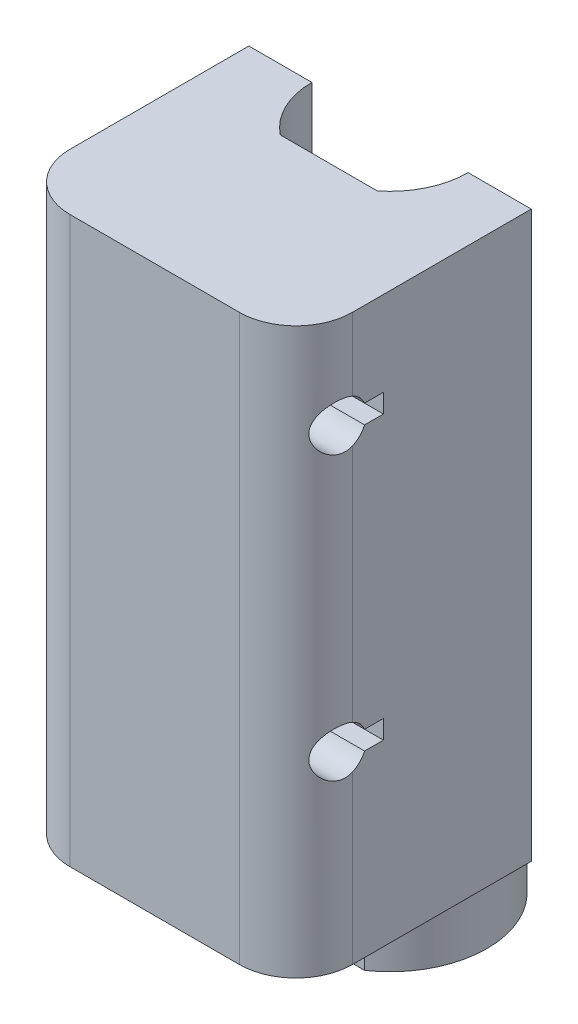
ISO-10303-21;
HEADER;
FILE_DESCRIPTION(('STEP AP214'),'2;1');
FILE_NAME('part.step','',(''),(''),'','','');
FILE_SCHEMA(('AUTOMOTIVE_DESIGN { 1 0 10303 214 1 1 1 1 }'));
ENDSEC;
DATA;
#1=APPLICATION_CONTEXT('core data for automotive mechanical design processes');
#2=APPLICATION_PROTOCOL_DEFINITION('international standard','automotive_design',2000,#1);
#3=PRODUCT_CONTEXT('',#1,'mechanical');
#4=PRODUCT('Part','Part','',(#3));
#5=PRODUCT_RELATED_PRODUCT_CATEGORY('part','',(#4));
#6=PRODUCT_DEFINITION_FORMATION('','',#4);
#7=PRODUCT_DEFINITION_CONTEXT('part definition',#1,'design');
#8=PRODUCT_DEFINITION('design','',#6,#7);
#9=PRODUCT_DEFINITION_SHAPE('','',#8);
#10=(LENGTH_UNIT() NAMED_UNIT(*) SI_UNIT(.MILLI.,.METRE.));
#11=(NAMED_UNIT(*) PLANE_ANGLE_UNIT() SI_UNIT($,.RADIAN.));
#12=(NAMED_UNIT(*) SI_UNIT($,.STERADIAN.) SOLID_ANGLE_UNIT());
#13=UNCERTAINTY_MEASURE_WITH_UNIT(LENGTH_MEASURE(1.E-05),#10,'distance_accuracy_value','');
#14=(GEOMETRIC_REPRESENTATION_CONTEXT(3) GLOBAL_UNCERTAINTY_ASSIGNED_CONTEXT((#13)) GLOBAL_UNIT_ASSIGNED_CONTEXT((#10,
#11,#12)) REPRESENTATION_CONTEXT('',''));
#15=CARTESIAN_POINT('',(0.,0.,0.));
#16=DIRECTION('',(0.,0.,1.));
#17=DIRECTION('',(1.,0.,0.));
#18=AXIS2_PLACEMENT_3D('',#15,#16,#17);
#19=CARTESIAN_POINT('',(-7.3692728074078,29.0576,10.8077));
#20=DIRECTION('',(0.,0.,-1.));
#21=DIRECTION('',(-1.,0.,0.));
#22=AXIS2_PLACEMENT_3D('',#19,#20,#21);
#23=PLANE('',#22);
#24=DIRECTION('',(0.,-1.,0.));
#25=VECTOR('',#24,1.);
#26=CARTESIAN_POINT('',(7.3692728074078,29.0576,10.8077));
#27=LINE('',#26,#25);
#28=CARTESIAN_POINT('',(7.3692728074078,23.4696,10.8077));
#29=VERTEX_POINT('',#28);
#30=CARTESIAN_POINT('',(7.3692728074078,15.875,10.8077));
#31=VERTEX_POINT('',#30);
#32=EDGE_CURVE('E530',#29,#31,#27,.T.);
#33=ORIENTED_EDGE('',*,*,#32,.F.);
#34=DIRECTION('',(-1.,0.,0.));
#35=VECTOR('',#34,1.);
#36=CARTESIAN_POINT('',(-7.3692728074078,23.4696,10.8077));
#37=LINE('',#36,#35);
#38=CARTESIAN_POINT('',(-7.3692728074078,23.4696,10.8077));
#39=VERTEX_POINT('',#38);
#40=EDGE_CURVE('E605',#29,#39,#37,.T.);
#41=ORIENTED_EDGE('',*,*,#40,.T.);
#42=DIRECTION('',(0.,-1.,0.));
#43=VECTOR('',#42,1.);
#44=CARTESIAN_POINT('',(-7.3692728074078,29.0576,10.8077));
#45=LINE('',#44,#43);
#46=CARTESIAN_POINT('',(-7.3692728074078,15.875,10.8077));
#47=VERTEX_POINT('',#46);
#48=EDGE_CURVE('E532',#39,#47,#45,.T.);
#49=ORIENTED_EDGE('',*,*,#48,.T.);
#50=DIRECTION('',(-1.,0.,0.));
#51=VECTOR('',#50,1.);
#52=CARTESIAN_POINT('',(-13.081,15.875,10.8077));
#53=LINE('',#52,#51);
#54=EDGE_CURVE('E591',#31,#47,#53,.T.);
#55=ORIENTED_EDGE('',*,*,#54,.F.);
#56=EDGE_LOOP('',(#33,#41,#49,#55));
#57=FACE_BOUND('',#56,.T.);
#58=ADVANCED_FACE('F45',(#57),#23,.F.);
#59=CARTESIAN_POINT('',(0.,29.0576,0.));
#60=DIRECTION('',(0.,1.,0.));
#61=DIRECTION('',(0.,0.,1.));
#62=AXIS2_PLACEMENT_3D('',#59,#60,#61);
#63=PLANE('',#62);
#64=CARTESIAN_POINT('',(0.,29.0576,0.));
#65=DIRECTION('',(0.,1.,0.));
#66=DIRECTION('',(0.,0.,1.));
#67=AXIS2_PLACEMENT_3D('',#64,#65,#66);
#68=CIRCLE('',#67,10.541);
#69=CARTESIAN_POINT('',(10.2303998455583,29.0576,2.54));
#70=VERTEX_POINT('',#69);
#71=CARTESIAN_POINT('',(6.53894622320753,29.0576,-8.2677));
#72=VERTEX_POINT('',#71);
#73=EDGE_CURVE('E550',#70,#72,#68,.T.);
#74=ORIENTED_EDGE('',*,*,#73,.F.);
#75=DIRECTION('',(-1.,0.,0.));
#76=VECTOR('',#75,1.);
#77=CARTESIAN_POINT('',(7.36927280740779,29.0576,2.54));
#78=LINE('',#77,#76);
#79=CARTESIAN_POINT('',(13.4652728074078,29.0576,2.54));
#80=VERTEX_POINT('',#79);
#81=EDGE_CURVE('E331',#80,#70,#78,.T.);
#82=ORIENTED_EDGE('',*,*,#81,.F.);
#83=DIRECTION('',(0.,0.,-1.));
#84=VECTOR('',#83,1.);
#85=CARTESIAN_POINT('',(13.4652728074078,29.0576,2.54));
#86=LINE('',#85,#84);
#87=CARTESIAN_POINT('',(13.4652728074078,29.0576,0.));
#88=VERTEX_POINT('',#87);
#89=EDGE_CURVE('E338',#80,#88,#86,.T.);
#90=ORIENTED_EDGE('',*,*,#89,.T.);
#91=DIRECTION('',(-1.,0.,0.));
#92=VECTOR('',#91,1.);
#93=CARTESIAN_POINT('',(7.36927280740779,29.0576,0.));
#94=LINE('',#93,#92);
#95=CARTESIAN_POINT('',(13.081,29.0576,0.));
#96=VERTEX_POINT('',#95);
#97=EDGE_CURVE('E328',#88,#96,#94,.T.);
#98=ORIENTED_EDGE('',*,*,#97,.T.);
#99=CARTESIAN_POINT('',(0.,29.0576,0.));
#100=DIRECTION('',(0.,1.,0.));
#101=DIRECTION('',(0.,0.,1.));
#102=AXIS2_PLACEMENT_3D('',#99,#100,#101);
#103=CIRCLE('',#102,13.081);
#104=CARTESIAN_POINT('',(7.36927280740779,29.0576,-10.8077));
#105=VERTEX_POINT('',#104);
#106=EDGE_CURVE('E534',#96,#105,#103,.T.);
#107=ORIENTED_EDGE('',*,*,#106,.T.);
#108=DIRECTION('',(-1.,0.,0.));
#109=VECTOR('',#108,1.);
#110=CARTESIAN_POINT('',(7.36927280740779,29.0576,-10.8077));
#111=LINE('',#110,#109);
#112=CARTESIAN_POINT('',(-7.36927280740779,29.0576,-10.8077));
#113=VERTEX_POINT('',#112);
#114=EDGE_CURVE('E528',#105,#113,#111,.T.);
#115=ORIENTED_EDGE('',*,*,#114,.T.);
#116=CARTESIAN_POINT('',(0.,29.0576,0.));
#117=DIRECTION('',(0.,1.,0.));
#118=DIRECTION('',(0.,0.,1.));
#119=AXIS2_PLACEMENT_3D('',#116,#117,#118);
#120=CIRCLE('',#119,13.081);
#121=CARTESIAN_POINT('',(-13.081,29.0576,0.));
#122=VERTEX_POINT('',#121);
#123=EDGE_CURVE('E521',#113,#122,#120,.T.);
#124=ORIENTED_EDGE('',*,*,#123,.T.);
#125=DIRECTION('',(1.,0.,0.));
#126=VECTOR('',#125,1.);
#127=CARTESIAN_POINT('',(-10.541,29.0576,0.));
#128=LINE('',#127,#126);
#129=CARTESIAN_POINT('',(-13.4652728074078,29.0576,0.));
#130=VERTEX_POINT('',#129);
#131=EDGE_CURVE('E54',#130,#122,#128,.T.);
#132=ORIENTED_EDGE('',*,*,#131,.F.);
#133=DIRECTION('',(0.,0.,-1.));
#134=VECTOR('',#133,1.);
#135=CARTESIAN_POINT('',(-13.4652728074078,29.0576,2.54));
#136=LINE('',#135,#134);
#137=CARTESIAN_POINT('',(-13.4652728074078,29.0576,2.54));
#138=VERTEX_POINT('',#137);
#139=EDGE_CURVE('E305',#138,#130,#136,.T.);
#140=ORIENTED_EDGE('',*,*,#139,.F.);
#141=DIRECTION('',(-1.,0.,0.));
#142=VECTOR('',#141,1.);
#143=CARTESIAN_POINT('',(-7.36927280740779,29.0576,2.54));
#144=LINE('',#143,#142);
#145=CARTESIAN_POINT('',(-10.2303998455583,29.0576,2.54));
#146=VERTEX_POINT('',#145);
#147=EDGE_CURVE('E292',#146,#138,#144,.T.);
#148=ORIENTED_EDGE('',*,*,#147,.F.);
#149=CARTESIAN_POINT('',(0.,29.0576,0.));
#150=DIRECTION('',(0.,1.,0.));
#151=DIRECTION('',(0.,0.,1.));
#152=AXIS2_PLACEMENT_3D('',#149,#150,#151);
#153=CIRCLE('',#152,10.541);
#154=CARTESIAN_POINT('',(-6.53894622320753,29.0576,-8.2677));
#155=VERTEX_POINT('',#154);
#156=EDGE_CURVE('E547',#155,#146,#153,.T.);
#157=ORIENTED_EDGE('',*,*,#156,.F.);
#158=DIRECTION('',(-1.,0.,0.));
#159=VECTOR('',#158,1.);
#160=CARTESIAN_POINT('',(6.53894622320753,29.0576,-8.2677));
#161=LINE('',#160,#159);
#162=EDGE_CURVE('E559',#72,#155,#161,.T.);
#163=ORIENTED_EDGE('',*,*,#162,.F.);
#164=EDGE_LOOP('',(#74,#82,#90,#98,#107,#115,#124,#132,#140,#148,#157,#163));
#165=FACE_BOUND('',#164,.T.);
#166=ADVANCED_FACE('F306',(#165),#63,.T.);
#167=CARTESIAN_POINT('',(0.,29.0576,0.));
#168=DIRECTION('',(0.,-1.,0.));
#169=DIRECTION('',(0.,0.,-1.));
#170=AXIS2_PLACEMENT_3D('',#167,#168,#169);
#171=CYLINDRICAL_SURFACE('',#170,13.081);
#172=ORIENTED_EDGE('',*,*,#106,.F.);
#173=DIRECTION('',(0.,-1.,0.));
#174=VECTOR('',#173,1.);
#175=CARTESIAN_POINT('',(13.081,29.0576,0.));
#176=LINE('',#175,#174);
#177=CARTESIAN_POINT('',(13.081,23.4696,0.));
#178=VERTEX_POINT('',#177);
#179=EDGE_CURVE('E525',#96,#178,#176,.T.);
#180=ORIENTED_EDGE('',*,*,#179,.T.);
#181=CARTESIAN_POINT('',(0.,23.4696,0.));
#182=DIRECTION('',(0.,1.,0.));
#183=DIRECTION('',(0.,0.,1.));
#184=AXIS2_PLACEMENT_3D('',#181,#182,#183);
#185=CIRCLE('',#184,13.081);
#186=EDGE_CURVE('E624',#178,#29,#185,.F.);
#187=ORIENTED_EDGE('',*,*,#186,.T.);
#188=ORIENTED_EDGE('',*,*,#32,.T.);
#189=CARTESIAN_POINT('',(0.,15.875,0.));
#190=DIRECTION('',(0.,1.,0.));
#191=DIRECTION('',(0.,0.,1.));
#192=AXIS2_PLACEMENT_3D('',#189,#190,#191);
#193=CIRCLE('',#192,13.081);
#194=CARTESIAN_POINT('',(7.36927280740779,15.875,-10.8077));
#195=VERTEX_POINT('',#194);
#196=EDGE_CURVE('E551',#31,#195,#193,.T.);
#197=ORIENTED_EDGE('',*,*,#196,.T.);
#198=DIRECTION('',(0.,-1.,0.));
#199=VECTOR('',#198,1.);
#200=CARTESIAN_POINT('',(7.36927280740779,29.0576,-10.8077));
#201=LINE('',#200,#199);
#202=EDGE_CURVE('E541',#105,#195,#201,.T.);
#203=ORIENTED_EDGE('',*,*,#202,.F.);
#204=EDGE_LOOP('',(#172,#180,#187,#188,#197,#203));
#205=FACE_BOUND('',#204,.T.);
#206=ADVANCED_FACE('F479',(#205),#171,.T.);
#207=CARTESIAN_POINT('',(7.36927280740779,29.0576,-10.8077));
#208=DIRECTION('',(0.,0.,1.));
#209=DIRECTION('',(1.,0.,0.));
#210=AXIS2_PLACEMENT_3D('',#207,#208,#209);
#211=PLANE('',#210);
#212=ORIENTED_EDGE('',*,*,#202,.T.);
#213=DIRECTION('',(-1.,0.,0.));
#214=VECTOR('',#213,1.);
#215=CARTESIAN_POINT('',(13.081,15.875,-10.8077));
#216=LINE('',#215,#214);
#217=CARTESIAN_POINT('',(-7.36927280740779,15.875,-10.8077));
#218=VERTEX_POINT('',#217);
#219=EDGE_CURVE('E585',#195,#218,#216,.T.);
#220=ORIENTED_EDGE('',*,*,#219,.T.);
#221=DIRECTION('',(0.,-1.,0.));
#222=VECTOR('',#221,1.);
#223=CARTESIAN_POINT('',(-7.36927280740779,29.0576,-10.8077));
#224=LINE('',#223,#222);
#225=EDGE_CURVE('E539',#113,#218,#224,.T.);
#226=ORIENTED_EDGE('',*,*,#225,.F.);
#227=ORIENTED_EDGE('',*,*,#114,.F.);
#228=EDGE_LOOP('',(#212,#220,#226,#227));
#229=FACE_BOUND('',#228,.T.);
#230=ADVANCED_FACE('F485',(#229),#211,.F.);
#231=CARTESIAN_POINT('',(0.,29.0576,0.));
#232=DIRECTION('',(0.,-1.,0.));
#233=DIRECTION('',(0.,0.,-1.));
#234=AXIS2_PLACEMENT_3D('',#231,#232,#233);
#235=CYLINDRICAL_SURFACE('',#234,13.081);
#236=ORIENTED_EDGE('',*,*,#48,.F.);
#237=CARTESIAN_POINT('',(0.,23.4696,0.));
#238=DIRECTION('',(0.,1.,0.));
#239=DIRECTION('',(0.,0.,1.));
#240=AXIS2_PLACEMENT_3D('',#237,#238,#239);
#241=CIRCLE('',#240,13.081);
#242=CARTESIAN_POINT('',(-13.081,23.4696,0.));
#243=VERTEX_POINT('',#242);
#244=EDGE_CURVE('E523',#39,#243,#241,.F.);
#245=ORIENTED_EDGE('',*,*,#244,.T.);
#246=DIRECTION('',(0.,-1.,0.));
#247=VECTOR('',#246,1.);
#248=CARTESIAN_POINT('',(-13.081,23.4696,0.));
#249=LINE('',#248,#247);
#250=EDGE_CURVE('E69',#243,#122,#249,.F.);
#251=ORIENTED_EDGE('',*,*,#250,.T.);
#252=ORIENTED_EDGE('',*,*,#123,.F.);
#253=ORIENTED_EDGE('',*,*,#225,.T.);
#254=CARTESIAN_POINT('',(0.,15.875,0.));
#255=DIRECTION('',(0.,1.,0.));
#256=DIRECTION('',(0.,0.,1.));
#257=AXIS2_PLACEMENT_3D('',#254,#255,#256);
#258=CIRCLE('',#257,13.081);
#259=EDGE_CURVE('E584',#218,#47,#258,.T.);
#260=ORIENTED_EDGE('',*,*,#259,.T.);
#261=EDGE_LOOP('',(#236,#245,#251,#252,#253,#260));
#262=FACE_BOUND('',#261,.T.);
#263=ADVANCED_FACE('F475',(#262),#235,.T.);
#264=CARTESIAN_POINT('',(0.,29.0576,0.));
#265=DIRECTION('',(0.,-1.,0.));
#266=DIRECTION('',(0.,0.,-1.));
#267=AXIS2_PLACEMENT_3D('',#264,#265,#266);
#268=CYLINDRICAL_SURFACE('',#267,10.541);
#269=CARTESIAN_POINT('',(0.,38.2016,0.));
#270=DIRECTION('',(0.,1.,0.));
#271=DIRECTION('',(0.,0.,1.));
#272=AXIS2_PLACEMENT_3D('',#269,#270,#271);
#273=CIRCLE('',#272,10.541);
#274=CARTESIAN_POINT('',(-10.541,38.2016,0.));
#275=VERTEX_POINT('',#274);
#276=CARTESIAN_POINT('',(-10.2303998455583,38.2016,2.54));
#277=VERTEX_POINT('',#276);
#278=EDGE_CURVE('E321',#275,#277,#273,.T.);
#279=ORIENTED_EDGE('',*,*,#278,.F.);
#280=DIRECTION('',(0.,-1.,0.));
#281=VECTOR('',#280,1.);
#282=CARTESIAN_POINT('',(-10.541,105.2576,0.));
#283=LINE('',#282,#281);
#284=CARTESIAN_POINT('',(-10.541,105.2576,0.));
#285=VERTEX_POINT('',#284);
#286=EDGE_CURVE('E588',#285,#275,#283,.T.);
#287=ORIENTED_EDGE('',*,*,#286,.F.);
#288=CARTESIAN_POINT('',(0.,105.2576,0.));
#289=DIRECTION('',(0.,-1.,0.));
#290=DIRECTION('',(0.,0.,1.));
#291=AXIS2_PLACEMENT_3D('',#288,#289,#290);
#292=CIRCLE('',#291,10.541);
#293=CARTESIAN_POINT('',(-6.53894622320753,105.2576,8.26769999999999));
#294=VERTEX_POINT('',#293);
#295=EDGE_CURVE('E439',#294,#285,#292,.T.);
#296=ORIENTED_EDGE('',*,*,#295,.F.);
#297=DIRECTION('',(0.,-1.,0.));
#298=VECTOR('',#297,1.);
#299=CARTESIAN_POINT('',(-6.53894622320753,29.0576,8.26769999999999));
#300=LINE('',#299,#298);
#301=CARTESIAN_POINT('',(-6.53894622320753,15.875,8.26769999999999));
#302=VERTEX_POINT('',#301);
#303=EDGE_CURVE('E570',#294,#302,#300,.T.);
#304=ORIENTED_EDGE('',*,*,#303,.T.);
#305=CARTESIAN_POINT('',(0.,15.875,0.));
#306=DIRECTION('',(0.,1.,0.));
#307=DIRECTION('',(0.,0.,1.));
#308=AXIS2_PLACEMENT_3D('',#305,#306,#307);
#309=CIRCLE('',#308,10.541);
#310=CARTESIAN_POINT('',(-6.53894622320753,15.875,-8.2677));
#311=VERTEX_POINT('',#310);
#312=EDGE_CURVE('E600',#311,#302,#309,.T.);
#313=ORIENTED_EDGE('',*,*,#312,.F.);
#314=DIRECTION('',(0.,-1.,0.));
#315=VECTOR('',#314,1.);
#316=CARTESIAN_POINT('',(-6.53894622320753,29.0576,-8.2677));
#317=LINE('',#316,#315);
#318=EDGE_CURVE('E561',#155,#311,#317,.T.);
#319=ORIENTED_EDGE('',*,*,#318,.F.);
#320=ORIENTED_EDGE('',*,*,#156,.T.);
#321=DIRECTION('',(0.,-1.,0.));
#322=VECTOR('',#321,1.);
#323=CARTESIAN_POINT('',(-10.2303998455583,29.0576,2.54));
#324=LINE('',#323,#322);
#325=EDGE_CURVE('E13',#277,#146,#324,.T.);
#326=ORIENTED_EDGE('',*,*,#325,.F.);
#327=EDGE_LOOP('',(#279,#287,#296,#304,#313,#319,#320,#326));
#328=FACE_BOUND('',#327,.T.);
#329=ADVANCED_FACE('F471',(#328),#268,.F.);
#330=CARTESIAN_POINT('',(-6.53894622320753,29.0576,8.26769999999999));
#331=DIRECTION('',(0.,0.,-1.));
#332=DIRECTION('',(-1.,0.,0.));
#333=AXIS2_PLACEMENT_3D('',#330,#331,#332);
#334=PLANE('',#333);
#335=DIRECTION('',(1.,0.,0.));
#336=VECTOR('',#335,1.);
#337=CARTESIAN_POINT('',(-6.53894622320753,15.875,8.26769999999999));
#338=LINE('',#337,#336);
#339=CARTESIAN_POINT('',(6.53894622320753,15.875,8.2677));
#340=VERTEX_POINT('',#339);
#341=EDGE_CURVE('E598',#302,#340,#338,.T.);
#342=ORIENTED_EDGE('',*,*,#341,.F.);
#343=ORIENTED_EDGE('',*,*,#303,.F.);
#344=DIRECTION('',(-1.,0.,0.));
#345=VECTOR('',#344,1.);
#346=CARTESIAN_POINT('',(-6.53894622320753,105.2576,8.26769999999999));
#347=LINE('',#346,#345);
#348=CARTESIAN_POINT('',(6.53894622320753,105.2576,8.2677));
#349=VERTEX_POINT('',#348);
#350=EDGE_CURVE('E640',#349,#294,#347,.T.);
#351=ORIENTED_EDGE('',*,*,#350,.F.);
#352=DIRECTION('',(0.,-1.,0.));
#353=VECTOR('',#352,1.);
#354=CARTESIAN_POINT('',(6.53894622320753,29.0576,8.2677));
#355=LINE('',#354,#353);
#356=EDGE_CURVE('E567',#349,#340,#355,.T.);
#357=ORIENTED_EDGE('',*,*,#356,.T.);
#358=EDGE_LOOP('',(#342,#343,#351,#357));
#359=FACE_BOUND('',#358,.T.);
#360=ADVANCED_FACE('F467',(#359),#334,.T.);
#361=CARTESIAN_POINT('',(0.,29.0576,0.));
#362=DIRECTION('',(0.,-1.,0.));
#363=DIRECTION('',(0.,0.,-1.));
#364=AXIS2_PLACEMENT_3D('',#361,#362,#363);
#365=CYLINDRICAL_SURFACE('',#364,10.541);
#366=DIRECTION('',(0.,-1.,0.));
#367=VECTOR('',#366,1.);
#368=CARTESIAN_POINT('',(10.2303998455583,29.0576,2.54));
#369=LINE('',#368,#367);
#370=CARTESIAN_POINT('',(10.2303998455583,38.2016,2.54));
#371=VERTEX_POINT('',#370);
#372=EDGE_CURVE('E513',#371,#70,#369,.T.);
#373=ORIENTED_EDGE('',*,*,#372,.T.);
#374=ORIENTED_EDGE('',*,*,#73,.T.);
#375=DIRECTION('',(0.,-1.,0.));
#376=VECTOR('',#375,1.);
#377=CARTESIAN_POINT('',(6.53894622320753,29.0576,-8.2677));
#378=LINE('',#377,#376);
#379=CARTESIAN_POINT('',(6.53894622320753,15.875,-8.2677));
#380=VERTEX_POINT('',#379);
#381=EDGE_CURVE('E564',#72,#380,#378,.T.);
#382=ORIENTED_EDGE('',*,*,#381,.T.);
#383=CARTESIAN_POINT('',(0.,15.875,0.));
#384=DIRECTION('',(0.,1.,0.));
#385=DIRECTION('',(0.,0.,1.));
#386=AXIS2_PLACEMENT_3D('',#383,#384,#385);
#387=CIRCLE('',#386,10.541);
#388=EDGE_CURVE('E544',#340,#380,#387,.T.);
#389=ORIENTED_EDGE('',*,*,#388,.F.);
#390=ORIENTED_EDGE('',*,*,#356,.F.);
#391=CARTESIAN_POINT('',(0.,105.2576,0.));
#392=DIRECTION('',(0.,-1.,0.));
#393=DIRECTION('',(0.,0.,1.));
#394=AXIS2_PLACEMENT_3D('',#391,#392,#393);
#395=CIRCLE('',#394,10.541);
#396=CARTESIAN_POINT('',(10.541,105.2576,0.));
#397=VERTEX_POINT('',#396);
#398=EDGE_CURVE('E703',#397,#349,#395,.T.);
#399=ORIENTED_EDGE('',*,*,#398,.F.);
#400=DIRECTION('',(0.,-1.,0.));
#401=VECTOR('',#400,1.);
#402=CARTESIAN_POINT('',(10.541,105.2576,0.));
#403=LINE('',#402,#401);
#404=CARTESIAN_POINT('',(10.541,38.2016,0.));
#405=VERTEX_POINT('',#404);
#406=EDGE_CURVE('E658',#397,#405,#403,.T.);
#407=ORIENTED_EDGE('',*,*,#406,.T.);
#408=CARTESIAN_POINT('',(0.,38.2016,0.));
#409=DIRECTION('',(0.,1.,0.));
#410=DIRECTION('',(0.,0.,1.));
#411=AXIS2_PLACEMENT_3D('',#408,#409,#410);
#412=CIRCLE('',#411,10.541);
#413=EDGE_CURVE('E61',#371,#405,#412,.T.);
#414=ORIENTED_EDGE('',*,*,#413,.F.);
#415=EDGE_LOOP('',(#373,#374,#382,#389,#390,#399,#407,#414));
#416=FACE_BOUND('',#415,.T.);
#417=ADVANCED_FACE('F463',(#416),#365,.F.);
#418=CARTESIAN_POINT('',(6.53894622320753,29.0576,-8.2677));
#419=DIRECTION('',(0.,0.,1.));
#420=DIRECTION('',(1.,0.,0.));
#421=AXIS2_PLACEMENT_3D('',#418,#419,#420);
#422=PLANE('',#421);
#423=DIRECTION('',(-1.,0.,0.));
#424=VECTOR('',#423,1.);
#425=CARTESIAN_POINT('',(6.53894622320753,15.875,-8.2677));
#426=LINE('',#425,#424);
#427=EDGE_CURVE('E587',#380,#311,#426,.T.);
#428=ORIENTED_EDGE('',*,*,#427,.F.);
#429=ORIENTED_EDGE('',*,*,#381,.F.);
#430=ORIENTED_EDGE('',*,*,#162,.T.);
#431=ORIENTED_EDGE('',*,*,#318,.T.);
#432=EDGE_LOOP('',(#428,#429,#430,#431));
#433=FACE_BOUND('',#432,.T.);
#434=ADVANCED_FACE('F459',(#433),#422,.T.);
#435=CARTESIAN_POINT('',(-13.081,15.875,5.7277));
#436=DIRECTION('',(0.,1.,0.));
#437=DIRECTION('',(0.,0.,1.));
#438=AXIS2_PLACEMENT_3D('',#435,#436,#437);
#439=PLANE('',#438);
#440=ORIENTED_EDGE('',*,*,#388,.T.);
#441=ORIENTED_EDGE('',*,*,#427,.T.);
#442=ORIENTED_EDGE('',*,*,#312,.T.);
#443=ORIENTED_EDGE('',*,*,#341,.T.);
#444=EDGE_LOOP('',(#440,#441,#442,#443));
#445=FACE_BOUND('',#444,.T.);
#446=ORIENTED_EDGE('',*,*,#54,.T.);
#447=ORIENTED_EDGE('',*,*,#259,.F.);
#448=ORIENTED_EDGE('',*,*,#219,.F.);
#449=ORIENTED_EDGE('',*,*,#196,.F.);
#450=EDGE_LOOP('',(#446,#447,#448,#449));
#451=FACE_BOUND('',#450,.T.);
#452=ADVANCED_FACE('F456',(#445,#451),#439,.F.);
#453=CARTESIAN_POINT('',(0.,29.0576,0.));
#454=DIRECTION('',(0.,1.,0.));
#455=DIRECTION('',(0.,0.,1.));
#456=AXIS2_PLACEMENT_3D('',#453,#454,#455);
#457=PLANE('',#456);
#458=DIRECTION('',(1.,0.,0.));
#459=VECTOR('',#458,1.);
#460=CARTESIAN_POINT('',(7.3692728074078,29.0576,16.3957));
#461=LINE('',#460,#459);
#462=CARTESIAN_POINT('',(-8.92819032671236,29.0576,16.3957));
#463=VERTEX_POINT('',#462);
#464=CARTESIAN_POINT('',(8.92819032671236,29.0576,16.3957));
#465=VERTEX_POINT('',#464);
#466=EDGE_CURVE('E610',#463,#465,#461,.T.);
#467=ORIENTED_EDGE('',*,*,#466,.T.);
#468=CARTESIAN_POINT('',(0.,29.0576,0.));
#469=DIRECTION('',(0.,1.,0.));
#470=DIRECTION('',(0.,0.,1.));
#471=AXIS2_PLACEMENT_3D('',#468,#469,#470);
#472=CIRCLE('',#471,18.669);
#473=CARTESIAN_POINT('',(18.669,29.0576,0.));
#474=VERTEX_POINT('',#473);
#475=EDGE_CURVE('E617',#465,#474,#472,.T.);
#476=ORIENTED_EDGE('',*,*,#475,.T.);
#477=DIRECTION('',(-1.,0.,0.));
#478=VECTOR('',#477,1.);
#479=CARTESIAN_POINT('',(19.05,29.0576,0.));
#480=LINE('',#479,#478);
#481=CARTESIAN_POINT('',(19.05,29.0576,0.));
#482=VERTEX_POINT('',#481);
#483=EDGE_CURVE('E651',#482,#474,#480,.T.);
#484=ORIENTED_EDGE('',*,*,#483,.F.);
#485=DIRECTION('',(0.,0.,-1.));
#486=VECTOR('',#485,1.);
#487=CARTESIAN_POINT('',(19.05,29.0576,24.13));
#488=LINE('',#487,#486);
#489=CARTESIAN_POINT('',(19.05,29.0576,24.13));
#490=VERTEX_POINT('',#489);
#491=EDGE_CURVE('E649',#490,#482,#488,.T.);
#492=ORIENTED_EDGE('',*,*,#491,.F.);
#493=CARTESIAN_POINT('',(11.43,29.0576,24.13));
#494=DIRECTION('',(0.,1.,0.));
#495=DIRECTION('',(0.,0.,1.));
#496=AXIS2_PLACEMENT_3D('',#493,#494,#495);
#497=CIRCLE('',#496,7.62);
#498=CARTESIAN_POINT('',(11.43,29.0576,31.75));
#499=VERTEX_POINT('',#498);
#500=EDGE_CURVE('E646',#499,#490,#497,.T.);
#501=ORIENTED_EDGE('',*,*,#500,.F.);
#502=DIRECTION('',(1.,0.,0.));
#503=VECTOR('',#502,1.);
#504=CARTESIAN_POINT('',(-11.43,29.0576,31.75));
#505=LINE('',#504,#503);
#506=CARTESIAN_POINT('',(-11.43,29.0576,31.75));
#507=VERTEX_POINT('',#506);
#508=EDGE_CURVE('E644',#507,#499,#505,.T.);
#509=ORIENTED_EDGE('',*,*,#508,.F.);
#510=CARTESIAN_POINT('',(-11.43,29.0576,24.13));
#511=DIRECTION('',(0.,1.,0.));
#512=DIRECTION('',(0.,0.,1.));
#513=AXIS2_PLACEMENT_3D('',#510,#511,#512);
#514=CIRCLE('',#513,7.62);
#515=CARTESIAN_POINT('',(-19.05,29.0576,24.13));
#516=VERTEX_POINT('',#515);
#517=EDGE_CURVE('E637',#516,#507,#514,.T.);
#518=ORIENTED_EDGE('',*,*,#517,.F.);
#519=DIRECTION('',(0.,0.,1.));
#520=VECTOR('',#519,1.);
#521=CARTESIAN_POINT('',(-19.05,29.0576,0.));
#522=LINE('',#521,#520);
#523=CARTESIAN_POINT('',(-19.05,29.0576,0.));
#524=VERTEX_POINT('',#523);
#525=EDGE_CURVE('E635',#524,#516,#522,.T.);
#526=ORIENTED_EDGE('',*,*,#525,.F.);
#527=DIRECTION('',(-1.,0.,0.));
#528=VECTOR('',#527,1.);
#529=CARTESIAN_POINT('',(-10.541,29.0576,0.));
#530=LINE('',#529,#528);
#531=CARTESIAN_POINT('',(-18.669,29.0576,0.));
#532=VERTEX_POINT('',#531);
#533=EDGE_CURVE('E438',#532,#524,#530,.T.);
#534=ORIENTED_EDGE('',*,*,#533,.F.);
#535=CARTESIAN_POINT('',(0.,29.0576,0.));
#536=DIRECTION('',(0.,1.,0.));
#537=DIRECTION('',(0.,0.,1.));
#538=AXIS2_PLACEMENT_3D('',#535,#536,#537);
#539=CIRCLE('',#538,18.669);
#540=EDGE_CURVE('E614',#532,#463,#539,.T.);
#541=ORIENTED_EDGE('',*,*,#540,.T.);
#542=EDGE_LOOP('',(#467,#476,#484,#492,#501,#509,#518,#526,#534,#541));
#543=FACE_BOUND('',#542,.T.);
#544=ADVANCED_FACE('F455',(#543),#457,.F.);
#545=CARTESIAN_POINT('',(-10.541,105.2576,0.));
#546=DIRECTION('',(0.,0.,1.));
#547=DIRECTION('',(1.,0.,0.));
#548=AXIS2_PLACEMENT_3D('',#545,#546,#547);
#549=PLANE('',#548);
#550=ORIENTED_EDGE('',*,*,#286,.T.);
#551=DIRECTION('',(1.,0.,0.));
#552=VECTOR('',#551,1.);
#553=CARTESIAN_POINT('',(-7.36927280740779,38.2016,0.));
#554=LINE('',#553,#552);
#555=CARTESIAN_POINT('',(-13.4652728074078,38.2016,0.));
#556=VERTEX_POINT('',#555);
#557=EDGE_CURVE('E302',#556,#275,#554,.T.);
#558=ORIENTED_EDGE('',*,*,#557,.F.);
#559=DIRECTION('',(0.,1.,0.));
#560=VECTOR('',#559,1.);
#561=CARTESIAN_POINT('',(-13.4652728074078,29.0576,0.));
#562=LINE('',#561,#560);
#563=EDGE_CURVE('E318',#130,#556,#562,.T.);
#564=ORIENTED_EDGE('',*,*,#563,.F.);
#565=ORIENTED_EDGE('',*,*,#131,.T.);
#566=ORIENTED_EDGE('',*,*,#250,.F.);
#567=DIRECTION('',(0.707106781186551,-0.707106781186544,0.));
#568=VECTOR('',#567,1.);
#569=CARTESIAN_POINT('',(0.,10.3886000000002,0.));
#570=LINE('',#569,#568);
#571=EDGE_CURVE('E514',#243,#532,#570,.F.);
#572=ORIENTED_EDGE('',*,*,#571,.T.);
#573=ORIENTED_EDGE('',*,*,#533,.T.);
#574=DIRECTION('',(0.,-1.,0.));
#575=VECTOR('',#574,1.);
#576=CARTESIAN_POINT('',(-19.05,105.2576,0.));
#577=LINE('',#576,#575);
#578=CARTESIAN_POINT('',(-19.05,105.2576,0.));
#579=VERTEX_POINT('',#578);
#580=EDGE_CURVE('E593',#579,#524,#577,.T.);
#581=ORIENTED_EDGE('',*,*,#580,.F.);
#582=DIRECTION('',(-1.,0.,0.));
#583=VECTOR('',#582,1.);
#584=CARTESIAN_POINT('',(-10.541,105.2576,0.));
#585=LINE('',#584,#583);
#586=EDGE_CURVE('E781',#285,#579,#585,.T.);
#587=ORIENTED_EDGE('',*,*,#586,.F.);
#588=EDGE_LOOP('',(#550,#558,#564,#565,#566,#572,#573,#581,#587));
#589=FACE_BOUND('',#588,.T.);
#590=ADVANCED_FACE('F451',(#589),#549,.F.);
#591=CARTESIAN_POINT('',(-19.05,105.2576,0.));
#592=DIRECTION('',(1.,0.,0.));
#593=DIRECTION('',(0.,0.,-1.));
#594=AXIS2_PLACEMENT_3D('',#591,#592,#593);
#595=PLANE('',#594);
#596=DIRECTION('',(0.,0.,1.));
#597=VECTOR('',#596,1.);
#598=CARTESIAN_POINT('',(-19.05,93.8276,22.4900644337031));
#599=LINE('',#598,#597);
#600=CARTESIAN_POINT('',(-19.05,93.8276,19.9500644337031));
#601=VERTEX_POINT('',#600);
#602=CARTESIAN_POINT('',(-19.05,93.8276,22.4900644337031));
#603=VERTEX_POINT('',#602);
#604=EDGE_CURVE('E354',#601,#603,#599,.T.);
#605=ORIENTED_EDGE('',*,*,#604,.T.);
#606=CARTESIAN_POINT('',(-19.05,92.5576,25.4));
#607=DIRECTION('',(1.,0.,0.));
#608=DIRECTION('',(0.,0.,-1.));
#609=AXIS2_PLACEMENT_3D('',#606,#607,#608);
#610=CIRCLE('',#609,3.17499999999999);
#611=CARTESIAN_POINT('',(-19.05,95.4675355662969,24.13));
#612=VERTEX_POINT('',#611);
#613=EDGE_CURVE('E344',#603,#612,#610,.T.);
#614=ORIENTED_EDGE('',*,*,#613,.T.);
#615=DIRECTION('',(0.,-1.,0.));
#616=VECTOR('',#615,1.);
#617=CARTESIAN_POINT('',(-19.05,105.2576,24.13));
#618=LINE('',#617,#616);
#619=CARTESIAN_POINT('',(-19.05,105.2576,24.13));
#620=VERTEX_POINT('',#619);
#621=EDGE_CURVE('E669',#620,#612,#618,.T.);
#622=ORIENTED_EDGE('',*,*,#621,.F.);
#623=DIRECTION('',(0.,0.,1.));
#624=VECTOR('',#623,1.);
#625=CARTESIAN_POINT('',(-19.05,105.2576,0.));
#626=LINE('',#625,#624);
#627=EDGE_CURVE('E782',#579,#620,#626,.T.);
#628=ORIENTED_EDGE('',*,*,#627,.F.);
#629=ORIENTED_EDGE('',*,*,#580,.T.);
#630=ORIENTED_EDGE('',*,*,#525,.T.);
#631=CARTESIAN_POINT('',(-19.05,51.5476644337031,24.13));
#632=VERTEX_POINT('',#631);
#633=EDGE_CURVE('E668',#632,#516,#618,.T.);
#634=ORIENTED_EDGE('',*,*,#633,.F.);
#635=CARTESIAN_POINT('',(-19.05,54.4576,25.4));
#636=DIRECTION('',(1.,0.,0.));
#637=DIRECTION('',(0.,0.,-1.));
#638=AXIS2_PLACEMENT_3D('',#635,#636,#637);
#639=CIRCLE('',#638,3.175);
#640=CARTESIAN_POINT('',(-19.05,53.1876,22.490064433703));
#641=VERTEX_POINT('',#640);
#642=EDGE_CURVE('E746',#632,#641,#639,.T.);
#643=ORIENTED_EDGE('',*,*,#642,.T.);
#644=DIRECTION('',(0.,0.,-1.));
#645=VECTOR('',#644,1.);
#646=CARTESIAN_POINT('',(-19.05,53.1876,19.950064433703));
#647=LINE('',#646,#645);
#648=CARTESIAN_POINT('',(-19.05,53.1876,19.950064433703));
#649=VERTEX_POINT('',#648);
#650=EDGE_CURVE('E758',#641,#649,#647,.T.);
#651=ORIENTED_EDGE('',*,*,#650,.T.);
#652=DIRECTION('',(0.,1.,0.));
#653=VECTOR('',#652,1.);
#654=CARTESIAN_POINT('',(-19.05,55.7276,19.950064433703));
#655=LINE('',#654,#653);
#656=CARTESIAN_POINT('',(-19.05,55.7276,19.950064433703));
#657=VERTEX_POINT('',#656);
#658=EDGE_CURVE('E754',#649,#657,#655,.T.);
#659=ORIENTED_EDGE('',*,*,#658,.T.);
#660=DIRECTION('',(0.,0.,1.));
#661=VECTOR('',#660,1.);
#662=CARTESIAN_POINT('',(-19.05,55.7276,22.490064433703));
#663=LINE('',#662,#661);
#664=CARTESIAN_POINT('',(-19.05,55.7276,22.490064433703));
#665=VERTEX_POINT('',#664);
#666=EDGE_CURVE('E739',#657,#665,#663,.T.);
#667=ORIENTED_EDGE('',*,*,#666,.T.);
#668=CARTESIAN_POINT('',(-19.05,57.367535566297,24.13));
#669=VERTEX_POINT('',#668);
#670=EDGE_CURVE('E761',#665,#669,#639,.T.);
#671=ORIENTED_EDGE('',*,*,#670,.T.);
#672=CARTESIAN_POINT('',(-19.05,89.6476644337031,24.13));
#673=VERTEX_POINT('',#672);
#674=EDGE_CURVE('E671',#673,#669,#618,.T.);
#675=ORIENTED_EDGE('',*,*,#674,.F.);
#676=CARTESIAN_POINT('',(-19.05,91.2876,22.4900644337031));
#677=VERTEX_POINT('',#676);
#678=EDGE_CURVE('E348',#673,#677,#610,.T.);
#679=ORIENTED_EDGE('',*,*,#678,.T.);
#680=DIRECTION('',(0.,0.,-1.));
#681=VECTOR('',#680,1.);
#682=CARTESIAN_POINT('',(-19.05,91.2876,19.9500644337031));
#683=LINE('',#682,#681);
#684=CARTESIAN_POINT('',(-19.05,91.2876,19.9500644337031));
#685=VERTEX_POINT('',#684);
#686=EDGE_CURVE('E347',#677,#685,#683,.T.);
#687=ORIENTED_EDGE('',*,*,#686,.T.);
#688=DIRECTION('',(0.,1.,0.));
#689=VECTOR('',#688,1.);
#690=CARTESIAN_POINT('',(-19.05,93.8276,19.9500644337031));
#691=LINE('',#690,#689);
#692=EDGE_CURVE('E351',#685,#601,#691,.T.);
#693=ORIENTED_EDGE('',*,*,#692,.T.);
#694=EDGE_LOOP('',(#605,#614,#622,#628,#629,#630,#634,#643,#651,#659,#667,#671,#675,#679,#687,#693));
#695=FACE_BOUND('',#694,.T.);
#696=ADVANCED_FACE('F446',(#695),#595,.F.);
#697=CARTESIAN_POINT('',(-11.43,105.2576,24.13));
#698=DIRECTION('',(0.,-1.,0.));
#699=DIRECTION('',(0.,0.,-1.));
#700=AXIS2_PLACEMENT_3D('',#697,#698,#699);
#701=CYLINDRICAL_SURFACE('',#700,7.62);
#702=ORIENTED_EDGE('',*,*,#621,.T.);
#703=CARTESIAN_POINT('',(-18.8714387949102,93.8276,22.4900644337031));
#704=CARTESIAN_POINT('',(-18.8793127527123,93.9095183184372,22.5258187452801));
#705=CARTESIAN_POINT('',(-18.8876815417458,93.9898445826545,22.5649940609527));
#706=CARTESIAN_POINT('',(-18.9050057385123,94.1468607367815,22.6499360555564));
#707=CARTESIAN_POINT('',(-18.9139611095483,94.223550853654,22.6957023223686));
#708=CARTESIAN_POINT('',(-18.9411026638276,94.4474909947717,22.8425106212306));
#709=CARTESIAN_POINT('',(-18.9595657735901,94.5886249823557,22.9530683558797));
#710=CARTESIAN_POINT('',(-18.9936101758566,94.8505323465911,23.1965668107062));
#711=CARTESIAN_POINT('',(-19.0091895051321,94.9712918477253,23.3295226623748));
#712=CARTESIAN_POINT('',(-19.0338622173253,95.1888817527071,23.61421730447));
#713=CARTESIAN_POINT('',(-19.0429604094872,95.2857298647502,23.7659420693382));
#714=CARTESIAN_POINT('',(-19.0514269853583,95.450755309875,24.0804724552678));
#715=CARTESIAN_POINT('',(-19.0509956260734,95.5194918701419,24.2429785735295));
#716=CARTESIAN_POINT('',(-19.0387221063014,95.6290348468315,24.5767515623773));
#717=CARTESIAN_POINT('',(-19.0268819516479,95.669846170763,24.7480168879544));
#718=CARTESIAN_POINT('',(-18.9917002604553,95.7213339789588,25.0852136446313));
#719=CARTESIAN_POINT('',(-18.9689454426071,95.7333781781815,25.2509999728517));
#720=CARTESIAN_POINT('',(-18.9125320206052,95.7317434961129,25.5805394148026));
#721=CARTESIAN_POINT('',(-18.8788733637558,95.7180644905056,25.744292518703));
#722=CARTESIAN_POINT('',(-18.8015242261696,95.66605050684,26.0672450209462));
#723=CARTESIAN_POINT('',(-18.7577290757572,95.6274501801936,26.2263759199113));
#724=CARTESIAN_POINT('',(-18.6624003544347,95.5273229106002,26.5347607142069));
#725=CARTESIAN_POINT('',(-18.6108645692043,95.465789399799,26.6840117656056));
#726=CARTESIAN_POINT('',(-18.4978747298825,95.3155701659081,26.9825773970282));
#727=CARTESIAN_POINT('',(-18.435947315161,95.2249782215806,27.1307524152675));
#728=CARTESIAN_POINT('',(-18.3096871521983,95.0214909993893,27.4099127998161));
#729=CARTESIAN_POINT('',(-18.2453520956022,94.9085738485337,27.5408810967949));
#730=CARTESIAN_POINT('',(-18.112725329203,94.6511668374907,27.7944039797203));
#731=CARTESIAN_POINT('',(-18.0446111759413,94.5047321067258,27.9150882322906));
#732=CARTESIAN_POINT('',(-17.9170518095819,94.1901265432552,28.1297705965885));
#733=CARTESIAN_POINT('',(-17.8575971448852,94.0219797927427,28.2237979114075));
#734=CARTESIAN_POINT('',(-17.7659998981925,93.7063075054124,28.3637826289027));
#735=CARTESIAN_POINT('',(-17.7307267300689,93.5623624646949,28.4157618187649));
#736=CARTESIAN_POINT('',(-17.6734704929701,93.2660642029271,28.498758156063));
#737=CARTESIAN_POINT('',(-17.6514718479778,93.1137210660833,28.5297998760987));
#738=CARTESIAN_POINT('',(-17.6233566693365,92.8038997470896,28.5692969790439));
#739=CARTESIAN_POINT('',(-17.6173144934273,92.6464009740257,28.5776466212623));
#740=CARTESIAN_POINT('',(-17.622170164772,92.3321567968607,28.5708830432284));
#741=CARTESIAN_POINT('',(-17.6330699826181,92.1754114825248,28.555767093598));
#742=CARTESIAN_POINT('',(-17.668992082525,91.8786671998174,28.5049546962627));
#743=CARTESIAN_POINT('',(-17.6929601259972,91.7382682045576,28.4707907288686));
#744=CARTESIAN_POINT('',(-17.7517668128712,91.4654710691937,28.3846876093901));
#745=CARTESIAN_POINT('',(-17.7866091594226,91.333075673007,28.3327424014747));
#746=CARTESIAN_POINT('',(-17.8681953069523,91.0654179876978,28.2067881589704));
#747=CARTESIAN_POINT('',(-17.9157862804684,90.9312194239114,28.131079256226));
#748=CARTESIAN_POINT('',(-18.0168667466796,90.6766148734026,27.9623965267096));
#749=CARTESIAN_POINT('',(-18.0703598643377,90.5562174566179,27.8694120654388));
#750=CARTESIAN_POINT('',(-18.1894484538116,90.3107236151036,27.650279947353));
#751=CARTESIAN_POINT('',(-18.2555246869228,90.1884859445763,27.5211764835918));
#752=CARTESIAN_POINT('',(-18.3863756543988,89.9668572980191,27.2439617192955));
#753=CARTESIAN_POINT('',(-18.4511495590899,89.8674804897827,27.0958387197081));
#754=CARTESIAN_POINT('',(-18.5793637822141,89.6882684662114,26.7725722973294));
#755=CARTESIAN_POINT('',(-18.6424174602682,89.6102099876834,26.5962788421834));
#756=CARTESIAN_POINT('',(-18.7576399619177,89.4867169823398,26.229280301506));
#757=CARTESIAN_POINT('',(-18.8098165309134,89.4412591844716,26.0385856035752));
#758=CARTESIAN_POINT('',(-18.8962507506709,89.3884108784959,25.6641067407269));
#759=CARTESIAN_POINT('',(-18.9315955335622,89.378305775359,25.4809600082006));
#760=CARTESIAN_POINT('',(-18.9885332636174,89.3902187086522,25.113589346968));
#761=CARTESIAN_POINT('',(-19.0101342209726,89.4122180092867,24.9293661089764));
#762=CARTESIAN_POINT('',(-19.0382981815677,89.4848008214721,24.5833856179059));
#763=CARTESIAN_POINT('',(-19.0460657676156,89.5325568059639,24.4211248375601));
#764=CARTESIAN_POINT('',(-19.0515905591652,89.6532951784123,24.1061384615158));
#765=CARTESIAN_POINT('',(-19.0493491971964,89.72627395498,23.9534115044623));
#766=CARTESIAN_POINT('',(-19.0370414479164,89.8948221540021,23.6626721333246));
#767=CARTESIAN_POINT('',(-19.02702454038,89.9902460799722,23.5245729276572));
#768=CARTESIAN_POINT('',(-19.001905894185,90.2013658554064,23.2653422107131));
#769=CARTESIAN_POINT('',(-18.9868016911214,90.3170715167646,23.1442189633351));
#770=CARTESIAN_POINT('',(-18.9542992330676,90.5670129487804,22.9207876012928));
#771=CARTESIAN_POINT('',(-18.9368825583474,90.7013979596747,22.818648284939));
#772=CARTESIAN_POINT('',(-18.9113765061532,90.9137113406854,22.6823999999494));
#773=CARTESIAN_POINT('',(-18.9029761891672,90.9862858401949,22.6398045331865));
#774=CARTESIAN_POINT('',(-18.8867173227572,91.1346363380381,22.560481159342));
#775=CARTESIAN_POINT('',(-18.8788588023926,91.2104125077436,22.5237535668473));
#776=CARTESIAN_POINT('',(-18.8714387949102,91.2876,22.4900644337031));
#777=B_SPLINE_CURVE_WITH_KNOTS('',3,(#703,#704,#705,#706,#707,#708,#709,#710,#711,#712,#713,
#714,#715,#716,#717,#718,#719,#720,#721,#722,#723,#724,#725,#726,#727,#728,#729,#730,#731,#732,
#733,#734,#735,#736,#737,#738,#739,#740,#741,#742,#743,#744,#745,#746,#747,#748,#749,#750,#751,
#752,#753,#754,#755,#756,#757,#758,#759,#760,#761,#762,#763,#764,#765,#766,#767,#768,#769,#770,
#771,#772,#773,#774,#775,#776),.UNSPECIFIED.,.F.,.F.,(4,2,2,2,2,2,2,2,2,2,2,2,2,2,2,2,2,2,2,2,2,
2,2,2,2,2,2,2,2,2,2,2,2,2,2,2,4),(0.,0.269010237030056,0.538003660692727,1.07594446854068,
1.61425016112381,2.15215599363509,2.67876906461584,3.20528956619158,3.70623009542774,
4.2071730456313,4.7135397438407,5.22005157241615,5.77093015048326,6.32235114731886,
6.92429489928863,7.52557664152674,7.99481489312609,8.463501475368,8.93436833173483,
9.4052899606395,9.84287841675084,10.2806160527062,10.7626149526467,11.2449115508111,
11.8115315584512,12.3785017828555,12.9838266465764,13.5887189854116,14.1460013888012,
14.7029586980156,15.2084783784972,15.7139257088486,16.2161827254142,16.7186833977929,
17.2254581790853,17.4789370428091,17.7324294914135),.UNSPECIFIED.);
#778=EDGE_CURVE('E385',#612,#673,#777,.T.);
#779=ORIENTED_EDGE('',*,*,#778,.T.);
#780=ORIENTED_EDGE('',*,*,#674,.T.);
#781=CARTESIAN_POINT('',(-19.05,57.367535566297,24.13));
#782=CARTESIAN_POINT('',(-19.0500101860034,57.4011092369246,24.2068985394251));
#783=CARTESIAN_POINT('',(-19.0488361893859,57.4316141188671,24.2851376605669));
#784=CARTESIAN_POINT('',(-19.04395023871,57.4863207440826,24.4437094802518));
#785=CARTESIAN_POINT('',(-19.0402383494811,57.510522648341,24.5240421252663));
#786=CARTESIAN_POINT('',(-19.0301201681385,57.5524051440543,24.6860072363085));
#787=CARTESIAN_POINT('',(-19.0237208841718,57.5701024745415,24.7676357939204));
#788=CARTESIAN_POINT('',(-19.0081533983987,57.5989881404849,24.931749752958));
#789=CARTESIAN_POINT('',(-18.998985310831,57.6101767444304,25.014235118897));
#790=CARTESIAN_POINT('',(-18.967256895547,57.6339375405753,25.2621602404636));
#791=CARTESIAN_POINT('',(-18.9404692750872,57.6367180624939,25.4281211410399));
#792=CARTESIAN_POINT('',(-18.8763121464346,57.6168345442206,25.756308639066));
#793=CARTESIAN_POINT('',(-18.8389407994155,57.5941660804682,25.9185345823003));
#794=CARTESIAN_POINT('',(-18.7543747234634,57.524332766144,26.2385186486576));
#795=CARTESIAN_POINT('',(-18.7069998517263,57.4766909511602,26.3961243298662));
#796=CARTESIAN_POINT('',(-18.6052523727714,57.3587630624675,26.7001971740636));
#797=CARTESIAN_POINT('',(-18.5508764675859,57.2884662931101,26.8466590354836));
#798=CARTESIAN_POINT('',(-18.4324845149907,57.119580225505,27.1394636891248));
#799=CARTESIAN_POINT('',(-18.3680442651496,57.0189204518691,27.2844409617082));
#800=CARTESIAN_POINT('',(-18.2382065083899,56.7952387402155,27.5556950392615));
#801=CARTESIAN_POINT('',(-18.1728081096,56.6721945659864,27.6819530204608));
#802=CARTESIAN_POINT('',(-18.0408171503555,56.3953085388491,27.9223233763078));
#803=CARTESIAN_POINT('',(-17.9745322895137,56.2398092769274,28.034709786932));
#804=CARTESIAN_POINT('',(-17.8533661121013,55.9078261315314,28.2309888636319));
#805=CARTESIAN_POINT('',(-17.7984665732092,55.731376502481,28.3149271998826));
#806=CARTESIAN_POINT('',(-17.7188599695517,55.4071930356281,28.4333040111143));
#807=CARTESIAN_POINT('',(-17.6900489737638,55.2630528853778,28.4748369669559));
#808=CARTESIAN_POINT('',(-17.6462711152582,54.968379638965,28.5372506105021));
#809=CARTESIAN_POINT('',(-17.6312887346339,54.8178539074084,28.5581544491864));
#810=CARTESIAN_POINT('',(-17.6169630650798,54.5141432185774,28.5781520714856));
#811=CARTESIAN_POINT('',(-17.6176661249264,54.3609517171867,28.5771812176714));
#812=CARTESIAN_POINT('',(-17.6347347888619,54.0571506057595,28.5533317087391));
#813=CARTESIAN_POINT('',(-17.6511066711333,53.906542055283,28.5304442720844));
#814=CARTESIAN_POINT('',(-17.6966130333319,53.6178279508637,28.4653706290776));
#815=CARTESIAN_POINT('',(-17.7252390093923,53.4794647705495,28.4239506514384));
#816=CARTESIAN_POINT('',(-17.7923643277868,53.2117242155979,28.323845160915));
#817=CARTESIAN_POINT('',(-17.8308670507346,53.0823499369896,28.265153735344));
#818=CARTESIAN_POINT('',(-17.9202235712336,52.8182048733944,28.1236519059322));
#819=CARTESIAN_POINT('',(-17.9720313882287,52.6849079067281,28.0387014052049));
#820=CARTESIAN_POINT('',(-18.0804810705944,52.433513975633,27.8511881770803));
#821=CARTESIAN_POINT('',(-18.137126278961,52.3154276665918,27.7486132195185));
#822=CARTESIAN_POINT('',(-18.261275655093,52.0775074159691,27.5092220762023));
#823=CARTESIAN_POINT('',(-18.3290165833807,51.9606604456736,27.3695483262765));
#824=CARTESIAN_POINT('',(-18.46140819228,51.7518562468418,27.0711365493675));
#825=CARTESIAN_POINT('',(-18.5260575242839,51.6599098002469,26.9123903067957));
#826=CARTESIAN_POINT('',(-18.6184902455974,51.541554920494,26.6595284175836));
#827=CARTESIAN_POINT('',(-18.6490387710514,51.5049046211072,26.5710880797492));
#828=CARTESIAN_POINT('',(-18.7075958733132,51.4395399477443,26.3905269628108));
#829=CARTESIAN_POINT('',(-18.7356056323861,51.4108218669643,26.2984079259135));
#830=CARTESIAN_POINT('',(-18.7886002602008,51.3617494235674,26.1111300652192));
#831=CARTESIAN_POINT('',(-18.8135854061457,51.3413942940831,26.0159715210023));
#832=CARTESIAN_POINT('',(-18.8601106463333,51.3094481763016,25.8234151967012));
#833=CARTESIAN_POINT('',(-18.8816527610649,51.2978520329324,25.7260187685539));
#834=CARTESIAN_POINT('',(-18.9191637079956,51.2843857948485,25.5389252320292));
#835=CARTESIAN_POINT('',(-18.9354641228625,51.2817134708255,25.4493517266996));
#836=CARTESIAN_POINT('',(-18.9648189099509,51.2840010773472,25.2698120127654));
#837=CARTESIAN_POINT('',(-18.9778749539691,51.2889570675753,25.1798460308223));
#838=CARTESIAN_POINT('',(-19.0006741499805,51.3065659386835,25.0003292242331));
#839=CARTESIAN_POINT('',(-19.010420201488,51.3192120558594,24.910778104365));
#840=CARTESIAN_POINT('',(-19.0266419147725,51.3521694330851,24.732835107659));
#841=CARTESIAN_POINT('',(-19.0331190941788,51.37247712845,24.6444427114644));
#842=CARTESIAN_POINT('',(-19.0421146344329,51.4166170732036,24.4841635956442));
#843=CARTESIAN_POINT('',(-19.0451131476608,51.4392962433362,24.4119832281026));
#844=CARTESIAN_POINT('',(-19.0490570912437,51.4897170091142,24.2695106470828));
#845=CARTESIAN_POINT('',(-19.0500064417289,51.5174488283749,24.1992150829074));
#846=CARTESIAN_POINT('',(-19.05,51.547664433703,24.13));
#847=B_SPLINE_CURVE_WITH_KNOTS('',3,(#781,#782,#783,#784,#785,#786,#787,#788,#789,#790,#791,
#792,#793,#794,#795,#796,#797,#798,#799,#800,#801,#802,#803,#804,#805,#806,#807,#808,#809,#810,
#811,#812,#813,#814,#815,#816,#817,#818,#819,#820,#821,#822,#823,#824,#825,#826,#827,#828,#829,
#830,#831,#832,#833,#834,#835,#836,#837,#838,#839,#840,#841,#842,#843,#844,#845,#846),
.UNSPECIFIED.,.F.,.F.,(4,2,2,2,2,2,2,2,2,2,2,2,2,2,2,2,2,2,2,2,2,2,2,2,2,2,2,2,2,2,2,2,4),(0.,
0.251650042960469,0.503293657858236,0.754285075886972,1.00526613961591,1.50706866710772,
2.00895843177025,2.52080311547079,3.03288980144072,3.59421465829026,4.15610019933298,
4.7619970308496,5.36691650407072,5.82323689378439,6.27904459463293,6.73619933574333,
7.19353732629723,7.63350025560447,8.07361397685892,8.57076979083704,9.06827200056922,
9.64866568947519,10.2293102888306,10.5304347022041,10.8314181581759,11.1323740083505,
11.4331525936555,11.7060381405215,11.9787827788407,12.2512878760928,12.5236663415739,
12.7506073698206,12.9771138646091),.UNSPECIFIED.);
#848=EDGE_CURVE('E432',#669,#632,#847,.T.);
#849=ORIENTED_EDGE('',*,*,#848,.T.);
#850=ORIENTED_EDGE('',*,*,#633,.T.);
#851=ORIENTED_EDGE('',*,*,#517,.T.);
#852=DIRECTION('',(0.,-1.,0.));
#853=VECTOR('',#852,1.);
#854=CARTESIAN_POINT('',(-11.43,105.2576,31.75));
#855=LINE('',#854,#853);
#856=CARTESIAN_POINT('',(-11.43,105.2576,31.75));
#857=VERTEX_POINT('',#856);
#858=EDGE_CURVE('E666',#857,#507,#855,.T.);
#859=ORIENTED_EDGE('',*,*,#858,.F.);
#860=CARTESIAN_POINT('',(-11.43,105.2576,24.13));
#861=DIRECTION('',(0.,1.,0.));
#862=DIRECTION('',(0.,0.,1.));
#863=AXIS2_PLACEMENT_3D('',#860,#861,#862);
#864=CIRCLE('',#863,7.62);
#865=EDGE_CURVE('E699',#620,#857,#864,.T.);
#866=ORIENTED_EDGE('',*,*,#865,.F.);
#867=EDGE_LOOP('',(#702,#779,#780,#849,#850,#851,#859,#866));
#868=FACE_BOUND('',#867,.T.);
#869=ADVANCED_FACE('F441',(#868),#701,.T.);
#870=CARTESIAN_POINT('',(-11.43,105.2576,31.75));
#871=DIRECTION('',(0.,0.,-1.));
#872=DIRECTION('',(-1.,0.,0.));
#873=AXIS2_PLACEMENT_3D('',#870,#871,#872);
#874=PLANE('',#873);
#875=ORIENTED_EDGE('',*,*,#508,.T.);
#876=DIRECTION('',(0.,-1.,0.));
#877=VECTOR('',#876,1.);
#878=CARTESIAN_POINT('',(11.43,105.2576,31.75));
#879=LINE('',#878,#877);
#880=CARTESIAN_POINT('',(11.43,105.2576,31.75));
#881=VERTEX_POINT('',#880);
#882=EDGE_CURVE('E662',#881,#499,#879,.T.);
#883=ORIENTED_EDGE('',*,*,#882,.F.);
#884=DIRECTION('',(1.,0.,0.));
#885=VECTOR('',#884,1.);
#886=CARTESIAN_POINT('',(-11.43,105.2576,31.75));
#887=LINE('',#886,#885);
#888=EDGE_CURVE('E695',#857,#881,#887,.T.);
#889=ORIENTED_EDGE('',*,*,#888,.F.);
#890=ORIENTED_EDGE('',*,*,#858,.T.);
#891=EDGE_LOOP('',(#875,#883,#889,#890));
#892=FACE_BOUND('',#891,.T.);
#893=ADVANCED_FACE('F445',(#892),#874,.F.);
#894=CARTESIAN_POINT('',(11.43,105.2576,24.13));
#895=DIRECTION('',(0.,-1.,0.));
#896=DIRECTION('',(0.,0.,-1.));
#897=AXIS2_PLACEMENT_3D('',#894,#895,#896);
#898=CYLINDRICAL_SURFACE('',#897,7.62);
#899=DIRECTION('',(0.,-1.,0.));
#900=VECTOR('',#899,1.);
#901=CARTESIAN_POINT('',(19.05,105.2576,24.13));
#902=LINE('',#901,#900);
#903=CARTESIAN_POINT('',(19.05,89.6476644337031,24.13));
#904=VERTEX_POINT('',#903);
#905=CARTESIAN_POINT('',(19.05,57.367535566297,24.13));
#906=VERTEX_POINT('',#905);
#907=EDGE_CURVE('E663',#904,#906,#902,.T.);
#908=ORIENTED_EDGE('',*,*,#907,.F.);
#909=CARTESIAN_POINT('',(18.8714387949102,91.2876,22.4900644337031));
#910=CARTESIAN_POINT('',(18.8793127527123,91.2056816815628,22.5258187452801));
#911=CARTESIAN_POINT('',(18.8876815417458,91.1253554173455,22.5649940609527));
#912=CARTESIAN_POINT('',(18.9050057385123,90.9683392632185,22.6499360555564));
#913=CARTESIAN_POINT('',(18.9139611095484,90.891649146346,22.6957023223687));
#914=CARTESIAN_POINT('',(18.9411026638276,90.6677090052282,22.8425106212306));
#915=CARTESIAN_POINT('',(18.9595657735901,90.5265750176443,22.9530683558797));
#916=CARTESIAN_POINT('',(18.9936101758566,90.2646676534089,23.1965668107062));
#917=CARTESIAN_POINT('',(19.0091895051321,90.1439081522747,23.3295226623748));
#918=CARTESIAN_POINT('',(19.0338622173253,89.9263182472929,23.61421730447));
#919=CARTESIAN_POINT('',(19.0429604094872,89.8294701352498,23.7659420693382));
#920=CARTESIAN_POINT('',(19.0514269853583,89.664444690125,24.0804724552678));
#921=CARTESIAN_POINT('',(19.0509956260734,89.5957081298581,24.2429785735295));
#922=CARTESIAN_POINT('',(19.0387221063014,89.4861651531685,24.5767515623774));
#923=CARTESIAN_POINT('',(19.0268819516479,89.445353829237,24.7480168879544));
#924=CARTESIAN_POINT('',(18.9917002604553,89.3938660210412,25.0852136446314));
#925=CARTESIAN_POINT('',(18.9689454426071,89.3818218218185,25.2509999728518));
#926=CARTESIAN_POINT('',(18.9125320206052,89.3834565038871,25.5805394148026));
#927=CARTESIAN_POINT('',(18.8788733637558,89.3971355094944,25.744292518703));
#928=CARTESIAN_POINT('',(18.8015242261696,89.44914949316,26.0672450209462));
#929=CARTESIAN_POINT('',(18.7577290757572,89.4877498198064,26.2263759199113));
#930=CARTESIAN_POINT('',(18.6624003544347,89.5878770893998,26.5347607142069));
#931=CARTESIAN_POINT('',(18.6108645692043,89.649410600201,26.6840117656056));
#932=CARTESIAN_POINT('',(18.4978747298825,89.7996298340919,26.9825773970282));
#933=CARTESIAN_POINT('',(18.435947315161,89.8902217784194,27.1307524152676));
#934=CARTESIAN_POINT('',(18.3096871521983,90.0937090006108,27.4099127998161));
#935=CARTESIAN_POINT('',(18.2453520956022,90.2066261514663,27.5408810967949));
#936=CARTESIAN_POINT('',(18.112725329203,90.4640331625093,27.7944039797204));
#937=CARTESIAN_POINT('',(18.0446111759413,90.6104678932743,27.9150882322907));
#938=CARTESIAN_POINT('',(17.9170518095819,90.9250734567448,28.1297705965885));
#939=CARTESIAN_POINT('',(17.8575971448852,91.0932202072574,28.2237979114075));
#940=CARTESIAN_POINT('',(17.7659998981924,91.4088924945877,28.3637826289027));
#941=CARTESIAN_POINT('',(17.7307267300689,91.5528375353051,28.4157618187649));
#942=CARTESIAN_POINT('',(17.6734704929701,91.8491357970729,28.498758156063));
#943=CARTESIAN_POINT('',(17.6514718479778,92.0014789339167,28.5297998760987));
#944=CARTESIAN_POINT('',(17.6233566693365,92.3113002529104,28.5692969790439));
#945=CARTESIAN_POINT('',(17.6173144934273,92.4687990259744,28.5776466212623));
#946=CARTESIAN_POINT('',(17.622170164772,92.7830432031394,28.5708830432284));
#947=CARTESIAN_POINT('',(17.6330699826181,92.9397885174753,28.555767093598));
#948=CARTESIAN_POINT('',(17.668992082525,93.2365328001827,28.5049546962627));
#949=CARTESIAN_POINT('',(17.6929601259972,93.3769317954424,28.4707907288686));
#950=CARTESIAN_POINT('',(17.7517668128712,93.6497289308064,28.3846876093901));
#951=CARTESIAN_POINT('',(17.7866091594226,93.7821243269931,28.3327424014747));
#952=CARTESIAN_POINT('',(17.8681953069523,94.0497820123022,28.2067881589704));
#953=CARTESIAN_POINT('',(17.9157862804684,94.1839805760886,28.1310792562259));
#954=CARTESIAN_POINT('',(18.0168667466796,94.4385851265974,27.9623965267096));
#955=CARTESIAN_POINT('',(18.0703598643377,94.5589825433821,27.8694120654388));
#956=CARTESIAN_POINT('',(18.1894484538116,94.8044763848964,27.650279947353));
#957=CARTESIAN_POINT('',(18.2555246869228,94.9267140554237,27.5211764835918));
#958=CARTESIAN_POINT('',(18.3863756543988,95.1483427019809,27.2439617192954));
#959=CARTESIAN_POINT('',(18.4511495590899,95.2477195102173,27.095838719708));
#960=CARTESIAN_POINT('',(18.5793637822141,95.4269315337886,26.7725722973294));
#961=CARTESIAN_POINT('',(18.6424174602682,95.5049900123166,26.5962788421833));
#962=CARTESIAN_POINT('',(18.7576399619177,95.6284830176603,26.2292803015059));
#963=CARTESIAN_POINT('',(18.8098165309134,95.6739408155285,26.0385856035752));
#964=CARTESIAN_POINT('',(18.8962507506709,95.7267891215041,25.6641067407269));
#965=CARTESIAN_POINT('',(18.9315955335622,95.736894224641,25.4809600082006));
#966=CARTESIAN_POINT('',(18.9885332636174,95.7249812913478,25.113589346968));
#967=CARTESIAN_POINT('',(19.0101342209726,95.7029819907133,24.9293661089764));
#968=CARTESIAN_POINT('',(19.0382981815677,95.6303991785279,24.5833856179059));
#969=CARTESIAN_POINT('',(19.0460657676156,95.5826431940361,24.4211248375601));
#970=CARTESIAN_POINT('',(19.0515905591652,95.4619048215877,24.1061384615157));
#971=CARTESIAN_POINT('',(19.0493491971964,95.3889260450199,23.9534115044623));
#972=CARTESIAN_POINT('',(19.0370414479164,95.2203778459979,23.6626721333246));
#973=CARTESIAN_POINT('',(19.02702454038,95.1249539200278,23.5245729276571));
#974=CARTESIAN_POINT('',(19.001905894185,94.9138341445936,23.265342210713));
#975=CARTESIAN_POINT('',(18.9868016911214,94.7981284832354,23.144218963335));
#976=CARTESIAN_POINT('',(18.9542992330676,94.5481870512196,22.9207876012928));
#977=CARTESIAN_POINT('',(18.9368825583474,94.4138020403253,22.818648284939));
#978=CARTESIAN_POINT('',(18.9113765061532,94.2014886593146,22.6823999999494));
#979=CARTESIAN_POINT('',(18.9029761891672,94.128914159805,22.6398045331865));
#980=CARTESIAN_POINT('',(18.8867173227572,93.9805636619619,22.560481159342));
#981=CARTESIAN_POINT('',(18.8788588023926,93.9047874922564,22.5237535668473));
#982=CARTESIAN_POINT('',(18.8714387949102,93.8276,22.4900644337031));
#983=B_SPLINE_CURVE_WITH_KNOTS('',3,(#909,#910,#911,#912,#913,#914,#915,#916,#917,#918,#919,
#920,#921,#922,#923,#924,#925,#926,#927,#928,#929,#930,#931,#932,#933,#934,#935,#936,#937,#938,
#939,#940,#941,#942,#943,#944,#945,#946,#947,#948,#949,#950,#951,#952,#953,#954,#955,#956,#957,
#958,#959,#960,#961,#962,#963,#964,#965,#966,#967,#968,#969,#970,#971,#972,#973,#974,#975,#976,
#977,#978,#979,#980,#981,#982),.UNSPECIFIED.,.F.,.F.,(4,2,2,2,2,2,2,2,2,2,2,2,2,2,2,2,2,2,2,2,2,
2,2,2,2,2,2,2,2,2,2,2,2,2,2,2,4),(0.,0.269010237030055,0.53800366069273,1.07594446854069,
1.61425016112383,2.15215599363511,2.67876906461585,3.20528956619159,3.70623009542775,
4.20717304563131,4.71353974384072,5.22005157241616,5.77093015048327,6.32235114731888,
6.92429489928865,7.52557664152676,7.99481489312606,8.463501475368,8.93436833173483,
9.4052899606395,9.84287841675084,10.2806160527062,10.7626149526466,11.2449115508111,
11.8115315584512,12.3785017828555,12.9838266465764,13.5887189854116,14.1460013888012,
14.7029586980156,15.2084783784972,15.7139257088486,16.2161827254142,16.7186833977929,
17.2254581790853,17.4789370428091,17.7324294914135),.UNSPECIFIED.);
#984=CARTESIAN_POINT('',(19.05,95.4675355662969,24.13));
#985=VERTEX_POINT('',#984);
#986=EDGE_CURVE('E372',#904,#985,#983,.T.);
#987=ORIENTED_EDGE('',*,*,#986,.T.);
#988=CARTESIAN_POINT('',(19.05,105.2576,24.13));
#989=VERTEX_POINT('',#988);
#990=EDGE_CURVE('E659',#989,#985,#902,.T.);
#991=ORIENTED_EDGE('',*,*,#990,.F.);
#992=CARTESIAN_POINT('',(11.43,105.2576,24.13));
#993=DIRECTION('',(0.,1.,0.));
#994=DIRECTION('',(0.,0.,1.));
#995=AXIS2_PLACEMENT_3D('',#992,#993,#994);
#996=CIRCLE('',#995,7.62);
#997=EDGE_CURVE('E691',#881,#989,#996,.T.);
#998=ORIENTED_EDGE('',*,*,#997,.F.);
#999=ORIENTED_EDGE('',*,*,#882,.T.);
#1000=ORIENTED_EDGE('',*,*,#500,.T.);
#1001=CARTESIAN_POINT('',(19.05,51.547664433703,24.13));
#1002=VERTEX_POINT('',#1001);
#1003=EDGE_CURVE('E657',#1002,#490,#902,.T.);
#1004=ORIENTED_EDGE('',*,*,#1003,.F.);
#1005=CARTESIAN_POINT('',(19.05,51.547664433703,24.13));
#1006=CARTESIAN_POINT('',(19.0500101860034,51.5140907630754,24.2068985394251));
#1007=CARTESIAN_POINT('',(19.0488361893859,51.4835858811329,24.2851376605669));
#1008=CARTESIAN_POINT('',(19.04395023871,51.4288792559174,24.4437094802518));
#1009=CARTESIAN_POINT('',(19.0402383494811,51.404677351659,24.5240421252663));
#1010=CARTESIAN_POINT('',(19.0301201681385,51.3627948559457,24.6860072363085));
#1011=CARTESIAN_POINT('',(19.0237208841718,51.3450975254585,24.7676357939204));
#1012=CARTESIAN_POINT('',(19.0081533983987,51.3162118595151,24.931749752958));
#1013=CARTESIAN_POINT('',(18.998985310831,51.3050232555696,25.014235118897));
#1014=CARTESIAN_POINT('',(18.967256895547,51.2812624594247,25.2621602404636));
#1015=CARTESIAN_POINT('',(18.9404692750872,51.2784819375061,25.4281211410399));
#1016=CARTESIAN_POINT('',(18.8763121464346,51.2983654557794,25.756308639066));
#1017=CARTESIAN_POINT('',(18.8389407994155,51.3210339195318,25.9185345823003));
#1018=CARTESIAN_POINT('',(18.7543747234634,51.390867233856,26.2385186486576));
#1019=CARTESIAN_POINT('',(18.7069998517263,51.4385090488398,26.3961243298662));
#1020=CARTESIAN_POINT('',(18.6052523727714,51.5564369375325,26.7001971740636));
#1021=CARTESIAN_POINT('',(18.5508764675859,51.6267337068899,26.8466590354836));
#1022=CARTESIAN_POINT('',(18.4324845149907,51.795619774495,27.1394636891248));
#1023=CARTESIAN_POINT('',(18.3680442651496,51.8962795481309,27.2844409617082));
#1024=CARTESIAN_POINT('',(18.2382065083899,52.1199612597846,27.5556950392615));
#1025=CARTESIAN_POINT('',(18.1728081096,52.2430054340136,27.6819530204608));
#1026=CARTESIAN_POINT('',(18.0408171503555,52.5198914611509,27.9223233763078));
#1027=CARTESIAN_POINT('',(17.9745322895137,52.6753907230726,28.034709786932));
#1028=CARTESIAN_POINT('',(17.8533661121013,53.0073738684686,28.2309888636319));
#1029=CARTESIAN_POINT('',(17.7984665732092,53.183823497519,28.3149271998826));
#1030=CARTESIAN_POINT('',(17.7188599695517,53.5080069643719,28.4333040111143));
#1031=CARTESIAN_POINT('',(17.6900489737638,53.6521471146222,28.4748369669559));
#1032=CARTESIAN_POINT('',(17.6462711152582,53.946820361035,28.5372506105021));
#1033=CARTESIAN_POINT('',(17.6312887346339,54.0973460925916,28.5581544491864));
#1034=CARTESIAN_POINT('',(17.6169630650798,54.4010567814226,28.5781520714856));
#1035=CARTESIAN_POINT('',(17.6176661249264,54.5542482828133,28.5771812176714));
#1036=CARTESIAN_POINT('',(17.6347347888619,54.8580493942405,28.5533317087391));
#1037=CARTESIAN_POINT('',(17.6511066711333,55.008657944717,28.5304442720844));
#1038=CARTESIAN_POINT('',(17.6966130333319,55.2973720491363,28.4653706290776));
#1039=CARTESIAN_POINT('',(17.7252390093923,55.4357352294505,28.4239506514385));
#1040=CARTESIAN_POINT('',(17.7923643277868,55.7034757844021,28.323845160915));
#1041=CARTESIAN_POINT('',(17.8308670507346,55.8328500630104,28.265153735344));
#1042=CARTESIAN_POINT('',(17.9202235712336,56.0969951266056,28.1236519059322));
#1043=CARTESIAN_POINT('',(17.9720313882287,56.2302920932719,28.0387014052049));
#1044=CARTESIAN_POINT('',(18.0804810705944,56.4816860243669,27.8511881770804));
#1045=CARTESIAN_POINT('',(18.137126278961,56.5997723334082,27.7486132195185));
#1046=CARTESIAN_POINT('',(18.261275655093,56.8376925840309,27.5092220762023));
#1047=CARTESIAN_POINT('',(18.3290165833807,56.9545395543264,27.3695483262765));
#1048=CARTESIAN_POINT('',(18.46140819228,57.1633437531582,27.0711365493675));
#1049=CARTESIAN_POINT('',(18.5260575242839,57.2552901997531,26.9123903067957));
#1050=CARTESIAN_POINT('',(18.6184902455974,57.373645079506,26.6595284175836));
#1051=CARTESIAN_POINT('',(18.6490387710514,57.4102953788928,26.5710880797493));
#1052=CARTESIAN_POINT('',(18.7075958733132,57.4756600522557,26.3905269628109));
#1053=CARTESIAN_POINT('',(18.7356056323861,57.5043781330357,26.2984079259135));
#1054=CARTESIAN_POINT('',(18.7886002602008,57.5534505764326,26.1111300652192));
#1055=CARTESIAN_POINT('',(18.8135854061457,57.5738057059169,26.0159715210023));
#1056=CARTESIAN_POINT('',(18.8601106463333,57.6057518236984,25.8234151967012));
#1057=CARTESIAN_POINT('',(18.8816527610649,57.6173479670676,25.726018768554));
#1058=CARTESIAN_POINT('',(18.9191637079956,57.6308142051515,25.5389252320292));
#1059=CARTESIAN_POINT('',(18.9354641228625,57.6334865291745,25.4493517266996));
#1060=CARTESIAN_POINT('',(18.9648189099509,57.6311989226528,25.2698120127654));
#1061=CARTESIAN_POINT('',(18.9778749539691,57.6262429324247,25.1798460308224));
#1062=CARTESIAN_POINT('',(19.0006741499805,57.6086340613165,25.0003292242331));
#1063=CARTESIAN_POINT('',(19.0104202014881,57.5959879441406,24.910778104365));
#1064=CARTESIAN_POINT('',(19.0266419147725,57.5630305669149,24.732835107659));
#1065=CARTESIAN_POINT('',(19.0331190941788,57.54272287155,24.6444427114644));
#1066=CARTESIAN_POINT('',(19.0421146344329,57.4985829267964,24.4841635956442));
#1067=CARTESIAN_POINT('',(19.0451131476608,57.4759037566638,24.4119832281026));
#1068=CARTESIAN_POINT('',(19.0490570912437,57.4254829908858,24.2695106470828));
#1069=CARTESIAN_POINT('',(19.050006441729,57.3977511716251,24.1992150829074));
#1070=CARTESIAN_POINT('',(19.05,57.367535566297,24.13));
#1071=B_SPLINE_CURVE_WITH_KNOTS('',3,(#1005,#1006,#1007,#1008,#1009,#1010,#1011,#1012,#1013,
#1014,#1015,#1016,#1017,#1018,#1019,#1020,#1021,#1022,#1023,#1024,#1025,#1026,#1027,#1028,#1029,
#1030,#1031,#1032,#1033,#1034,#1035,#1036,#1037,#1038,#1039,#1040,#1041,#1042,#1043,#1044,#1045,
#1046,#1047,#1048,#1049,#1050,#1051,#1052,#1053,#1054,#1055,#1056,#1057,#1058,#1059,#1060,#1061,
#1062,#1063,#1064,#1065,#1066,#1067,#1068,#1069,#1070),.UNSPECIFIED.,.F.,.F.,(4,2,2,2,2,2,2,2,2,
2,2,2,2,2,2,2,2,2,2,2,2,2,2,2,2,2,2,2,2,2,2,2,4),(0.,0.251650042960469,0.503293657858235,
0.754285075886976,1.00526613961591,1.50706866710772,2.00895843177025,2.52080311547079,
3.03288980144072,3.59421465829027,4.15610019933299,4.7619970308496,5.36691650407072,
5.82323689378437,6.2790445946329,6.73619933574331,7.1935373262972,7.63350025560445,
8.07361397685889,8.57076979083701,9.0682720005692,9.64866568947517,10.2293102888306,
10.5304347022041,10.8314181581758,11.1323740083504,11.4331525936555,11.7060381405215,
11.9787827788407,12.2512878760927,12.5236663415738,12.7506073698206,12.9771138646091),.UNSPECIFIED.);
#1072=EDGE_CURVE('E426',#1002,#906,#1071,.T.);
#1073=ORIENTED_EDGE('',*,*,#1072,.T.);
#1074=EDGE_LOOP('',(#908,#987,#991,#998,#999,#1000,#1004,#1073));
#1075=FACE_BOUND('',#1074,.T.);
#1076=ADVANCED_FACE('F391',(#1075),#898,.T.);
#1077=CARTESIAN_POINT('',(19.05,105.2576,24.13));
#1078=DIRECTION('',(-1.,0.,0.));
#1079=DIRECTION('',(0.,0.,1.));
#1080=AXIS2_PLACEMENT_3D('',#1077,#1078,#1079);
#1081=PLANE('',#1080);
#1082=DIRECTION('',(0.,0.,-1.));
#1083=VECTOR('',#1082,1.);
#1084=CARTESIAN_POINT('',(19.05,91.2876,19.9500644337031));
#1085=LINE('',#1084,#1083);
#1086=CARTESIAN_POINT('',(19.05,91.2876,22.4900644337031));
#1087=VERTEX_POINT('',#1086);
#1088=CARTESIAN_POINT('',(19.05,91.2876,19.9500644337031));
#1089=VERTEX_POINT('',#1088);
#1090=EDGE_CURVE('E360',#1087,#1089,#1085,.T.);
#1091=ORIENTED_EDGE('',*,*,#1090,.F.);
#1092=CARTESIAN_POINT('',(19.05,92.5576,25.4));
#1093=DIRECTION('',(-1.,0.,0.));
#1094=DIRECTION('',(0.,0.,1.));
#1095=AXIS2_PLACEMENT_3D('',#1092,#1093,#1094);
#1096=CIRCLE('',#1095,3.17499999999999);
#1097=EDGE_CURVE('E615',#1087,#904,#1096,.T.);
#1098=ORIENTED_EDGE('',*,*,#1097,.T.);
#1099=ORIENTED_EDGE('',*,*,#907,.T.);
#1100=CARTESIAN_POINT('',(19.05,54.4576,25.4));
#1101=DIRECTION('',(1.,0.,0.));
#1102=DIRECTION('',(0.,0.,-1.));
#1103=AXIS2_PLACEMENT_3D('',#1100,#1101,#1102);
#1104=CIRCLE('',#1103,3.175);
#1105=CARTESIAN_POINT('',(19.05,55.7276,22.490064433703));
#1106=VERTEX_POINT('',#1105);
#1107=EDGE_CURVE('E730',#1106,#906,#1104,.T.);
#1108=ORIENTED_EDGE('',*,*,#1107,.F.);
#1109=DIRECTION('',(0.,0.,1.));
#1110=VECTOR('',#1109,1.);
#1111=CARTESIAN_POINT('',(19.05,55.7276,22.490064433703));
#1112=LINE('',#1111,#1110);
#1113=CARTESIAN_POINT('',(19.05,55.7276,19.950064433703));
#1114=VERTEX_POINT('',#1113);
#1115=EDGE_CURVE('E744',#1114,#1106,#1112,.T.);
#1116=ORIENTED_EDGE('',*,*,#1115,.F.);
#1117=DIRECTION('',(0.,1.,0.));
#1118=VECTOR('',#1117,1.);
#1119=CARTESIAN_POINT('',(19.05,55.7276,19.950064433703));
#1120=LINE('',#1119,#1118);
#1121=CARTESIAN_POINT('',(19.05,53.1876,19.950064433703));
#1122=VERTEX_POINT('',#1121);
#1123=EDGE_CURVE('E736',#1122,#1114,#1120,.T.);
#1124=ORIENTED_EDGE('',*,*,#1123,.F.);
#1125=DIRECTION('',(0.,0.,-1.));
#1126=VECTOR('',#1125,1.);
#1127=CARTESIAN_POINT('',(19.05,53.1876,19.950064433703));
#1128=LINE('',#1127,#1126);
#1129=CARTESIAN_POINT('',(19.05,53.1876,22.490064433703));
#1130=VERTEX_POINT('',#1129);
#1131=EDGE_CURVE('E725',#1130,#1122,#1128,.T.);
#1132=ORIENTED_EDGE('',*,*,#1131,.F.);
#1133=CARTESIAN_POINT('',(19.05,54.4576,25.4));
#1134=DIRECTION('',(-1.,0.,0.));
#1135=DIRECTION('',(0.,0.,1.));
#1136=AXIS2_PLACEMENT_3D('',#1133,#1134,#1135);
#1137=CIRCLE('',#1136,3.175);
#1138=EDGE_CURVE('E546',#1130,#1002,#1137,.T.);
#1139=ORIENTED_EDGE('',*,*,#1138,.T.);
#1140=ORIENTED_EDGE('',*,*,#1003,.T.);
#1141=ORIENTED_EDGE('',*,*,#491,.T.);
#1142=DIRECTION('',(0.,-1.,0.));
#1143=VECTOR('',#1142,1.);
#1144=CARTESIAN_POINT('',(19.05,105.2576,0.));
#1145=LINE('',#1144,#1143);
#1146=CARTESIAN_POINT('',(19.05,105.2576,0.));
#1147=VERTEX_POINT('',#1146);
#1148=EDGE_CURVE('E654',#1147,#482,#1145,.T.);
#1149=ORIENTED_EDGE('',*,*,#1148,.F.);
#1150=DIRECTION('',(0.,0.,-1.));
#1151=VECTOR('',#1150,1.);
#1152=CARTESIAN_POINT('',(19.05,105.2576,24.13));
#1153=LINE('',#1152,#1151);
#1154=EDGE_CURVE('E694',#989,#1147,#1153,.T.);
#1155=ORIENTED_EDGE('',*,*,#1154,.F.);
#1156=ORIENTED_EDGE('',*,*,#990,.T.);
#1157=CARTESIAN_POINT('',(19.05,92.5576,25.4));
#1158=DIRECTION('',(1.,0.,0.));
#1159=DIRECTION('',(0.,0.,-1.));
#1160=AXIS2_PLACEMENT_3D('',#1157,#1158,#1159);
#1161=CIRCLE('',#1160,3.17499999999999);
#1162=CARTESIAN_POINT('',(19.05,93.8276,22.4900644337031));
#1163=VERTEX_POINT('',#1162);
#1164=EDGE_CURVE('E358',#1163,#985,#1161,.T.);
#1165=ORIENTED_EDGE('',*,*,#1164,.F.);
#1166=DIRECTION('',(0.,0.,1.));
#1167=VECTOR('',#1166,1.);
#1168=CARTESIAN_POINT('',(19.05,93.8276,22.4900644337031));
#1169=LINE('',#1168,#1167);
#1170=CARTESIAN_POINT('',(19.05,93.8276,19.9500644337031));
#1171=VERTEX_POINT('',#1170);
#1172=EDGE_CURVE('E367',#1171,#1163,#1169,.T.);
#1173=ORIENTED_EDGE('',*,*,#1172,.F.);
#1174=DIRECTION('',(0.,1.,0.));
#1175=VECTOR('',#1174,1.);
#1176=CARTESIAN_POINT('',(19.05,93.8276,19.9500644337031));
#1177=LINE('',#1176,#1175);
#1178=EDGE_CURVE('E364',#1089,#1171,#1177,.T.);
#1179=ORIENTED_EDGE('',*,*,#1178,.F.);
#1180=EDGE_LOOP('',(#1091,#1098,#1099,#1108,#1116,#1124,#1132,#1139,#1140,#1141,#1149,#1155,
#1156,#1165,#1173,#1179));
#1181=FACE_BOUND('',#1180,.T.);
#1182=ADVANCED_FACE('F722',(#1181),#1081,.F.);
#1183=CARTESIAN_POINT('',(19.05,105.2576,0.));
#1184=DIRECTION('',(0.,0.,1.));
#1185=DIRECTION('',(1.,0.,0.));
#1186=AXIS2_PLACEMENT_3D('',#1183,#1184,#1185);
#1187=PLANE('',#1186);
#1188=ORIENTED_EDGE('',*,*,#179,.F.);
#1189=ORIENTED_EDGE('',*,*,#97,.F.);
#1190=DIRECTION('',(0.,-1.,0.));
#1191=VECTOR('',#1190,1.);
#1192=CARTESIAN_POINT('',(13.4652728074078,29.0576,0.));
#1193=LINE('',#1192,#1191);
#1194=CARTESIAN_POINT('',(13.4652728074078,38.2016,0.));
#1195=VERTEX_POINT('',#1194);
#1196=EDGE_CURVE('E324',#1195,#88,#1193,.T.);
#1197=ORIENTED_EDGE('',*,*,#1196,.F.);
#1198=DIRECTION('',(-1.,0.,0.));
#1199=VECTOR('',#1198,1.);
#1200=CARTESIAN_POINT('',(19.05,38.2016,0.));
#1201=LINE('',#1200,#1199);
#1202=EDGE_CURVE('E511',#1195,#405,#1201,.T.);
#1203=ORIENTED_EDGE('',*,*,#1202,.T.);
#1204=ORIENTED_EDGE('',*,*,#406,.F.);
#1205=DIRECTION('',(-1.,0.,0.));
#1206=VECTOR('',#1205,1.);
#1207=CARTESIAN_POINT('',(19.05,105.2576,0.));
#1208=LINE('',#1207,#1206);
#1209=EDGE_CURVE('E697',#1147,#397,#1208,.T.);
#1210=ORIENTED_EDGE('',*,*,#1209,.F.);
#1211=ORIENTED_EDGE('',*,*,#1148,.T.);
#1212=ORIENTED_EDGE('',*,*,#483,.T.);
#1213=DIRECTION('',(0.707106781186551,0.707106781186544,0.));
#1214=VECTOR('',#1213,1.);
#1215=CARTESIAN_POINT('',(0.,10.3886000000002,0.));
#1216=LINE('',#1215,#1214);
#1217=EDGE_CURVE('E628',#474,#178,#1216,.F.);
#1218=ORIENTED_EDGE('',*,*,#1217,.T.);
#1219=EDGE_LOOP('',(#1188,#1189,#1197,#1203,#1204,#1210,#1211,#1212,#1218));
#1220=FACE_BOUND('',#1219,.T.);
#1221=ADVANCED_FACE('F774',(#1220),#1187,.F.);
#1222=CARTESIAN_POINT('',(0.,105.2576,0.));
#1223=DIRECTION('',(0.,1.,0.));
#1224=DIRECTION('',(0.,0.,1.));
#1225=AXIS2_PLACEMENT_3D('',#1222,#1223,#1224);
#1226=PLANE('',#1225);
#1227=ORIENTED_EDGE('',*,*,#295,.T.);
#1228=ORIENTED_EDGE('',*,*,#586,.T.);
#1229=ORIENTED_EDGE('',*,*,#627,.T.);
#1230=ORIENTED_EDGE('',*,*,#865,.T.);
#1231=ORIENTED_EDGE('',*,*,#888,.T.);
#1232=ORIENTED_EDGE('',*,*,#997,.T.);
#1233=ORIENTED_EDGE('',*,*,#1154,.T.);
#1234=ORIENTED_EDGE('',*,*,#1209,.T.);
#1235=ORIENTED_EDGE('',*,*,#398,.T.);
#1236=ORIENTED_EDGE('',*,*,#350,.T.);
#1237=EDGE_LOOP('',(#1227,#1228,#1229,#1230,#1231,#1232,#1233,#1234,#1235,#1236));
#1238=FACE_BOUND('',#1237,.T.);
#1239=ADVANCED_FACE('F421',(#1238),#1226,.T.);
#1240=CARTESIAN_POINT('',(-19.05,54.4576,25.4));
#1241=DIRECTION('',(1.,0.,0.));
#1242=DIRECTION('',(0.,0.,-1.));
#1243=AXIS2_PLACEMENT_3D('',#1240,#1241,#1242);
#1244=CYLINDRICAL_SURFACE('',#1243,3.175);
#1245=ORIENTED_EDGE('',*,*,#670,.F.);
#1246=DIRECTION('',(1.,0.,0.));
#1247=VECTOR('',#1246,1.);
#1248=CARTESIAN_POINT('',(-19.05,55.7276,22.490064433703));
#1249=LINE('',#1248,#1247);
#1250=EDGE_CURVE('E733',#665,#1106,#1249,.T.);
#1251=ORIENTED_EDGE('',*,*,#1250,.T.);
#1252=ORIENTED_EDGE('',*,*,#1107,.T.);
#1253=ORIENTED_EDGE('',*,*,#1072,.F.);
#1254=ORIENTED_EDGE('',*,*,#1138,.F.);
#1255=DIRECTION('',(1.,0.,0.));
#1256=VECTOR('',#1255,1.);
#1257=CARTESIAN_POINT('',(-19.05,53.1876,22.490064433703));
#1258=LINE('',#1257,#1256);
#1259=EDGE_CURVE('E751',#641,#1130,#1258,.T.);
#1260=ORIENTED_EDGE('',*,*,#1259,.F.);
#1261=ORIENTED_EDGE('',*,*,#642,.F.);
#1262=ORIENTED_EDGE('',*,*,#848,.F.);
#1263=EDGE_LOOP('',(#1245,#1251,#1252,#1253,#1254,#1260,#1261,#1262));
#1264=FACE_BOUND('',#1263,.T.);
#1265=ADVANCED_FACE('F410',(#1264),#1244,.F.);
#1266=CARTESIAN_POINT('',(-19.05,55.7276,22.490064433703));
#1267=DIRECTION('',(0.,1.,0.));
#1268=DIRECTION('',(0.,0.,1.));
#1269=AXIS2_PLACEMENT_3D('',#1266,#1267,#1268);
#1270=PLANE('',#1269);
#1271=ORIENTED_EDGE('',*,*,#1115,.T.);
#1272=ORIENTED_EDGE('',*,*,#1250,.F.);
#1273=ORIENTED_EDGE('',*,*,#666,.F.);
#1274=DIRECTION('',(1.,0.,0.));
#1275=VECTOR('',#1274,1.);
#1276=CARTESIAN_POINT('',(-19.05,55.7276,19.950064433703));
#1277=LINE('',#1276,#1275);
#1278=EDGE_CURVE('E748',#657,#1114,#1277,.T.);
#1279=ORIENTED_EDGE('',*,*,#1278,.T.);
#1280=EDGE_LOOP('',(#1271,#1272,#1273,#1279));
#1281=FACE_BOUND('',#1280,.T.);
#1282=ADVANCED_FACE('F405',(#1281),#1270,.F.);
#1283=CARTESIAN_POINT('',(-19.05,55.7276,19.950064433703));
#1284=DIRECTION('',(0.,0.,-1.));
#1285=DIRECTION('',(-1.,0.,0.));
#1286=AXIS2_PLACEMENT_3D('',#1283,#1284,#1285);
#1287=PLANE('',#1286);
#1288=ORIENTED_EDGE('',*,*,#1123,.T.);
#1289=ORIENTED_EDGE('',*,*,#1278,.F.);
#1290=ORIENTED_EDGE('',*,*,#658,.F.);
#1291=DIRECTION('',(1.,0.,0.));
#1292=VECTOR('',#1291,1.);
#1293=CARTESIAN_POINT('',(-19.05,53.1876,19.950064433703));
#1294=LINE('',#1293,#1292);
#1295=EDGE_CURVE('E750',#649,#1122,#1294,.T.);
#1296=ORIENTED_EDGE('',*,*,#1295,.T.);
#1297=EDGE_LOOP('',(#1288,#1289,#1290,#1296));
#1298=FACE_BOUND('',#1297,.T.);
#1299=ADVANCED_FACE('F409',(#1298),#1287,.F.);
#1300=CARTESIAN_POINT('',(-19.05,53.1876,19.950064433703));
#1301=DIRECTION('',(0.,-1.,0.));
#1302=DIRECTION('',(0.,0.,-1.));
#1303=AXIS2_PLACEMENT_3D('',#1300,#1301,#1302);
#1304=PLANE('',#1303);
#1305=ORIENTED_EDGE('',*,*,#1131,.T.);
#1306=ORIENTED_EDGE('',*,*,#1295,.F.);
#1307=ORIENTED_EDGE('',*,*,#650,.F.);
#1308=ORIENTED_EDGE('',*,*,#1259,.T.);
#1309=EDGE_LOOP('',(#1305,#1306,#1307,#1308));
#1310=FACE_BOUND('',#1309,.T.);
#1311=ADVANCED_FACE('F401',(#1310),#1304,.F.);
#1312=CARTESIAN_POINT('',(-19.05,92.5576,25.4));
#1313=DIRECTION('',(1.,0.,0.));
#1314=DIRECTION('',(0.,0.,-1.));
#1315=AXIS2_PLACEMENT_3D('',#1312,#1313,#1314);
#1316=CYLINDRICAL_SURFACE('',#1315,3.17499999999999);
#1317=ORIENTED_EDGE('',*,*,#613,.F.);
#1318=DIRECTION('',(1.,0.,0.));
#1319=VECTOR('',#1318,1.);
#1320=CARTESIAN_POINT('',(-19.05,93.8276,22.4900644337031));
#1321=LINE('',#1320,#1319);
#1322=EDGE_CURVE('E370',#603,#1163,#1321,.T.);
#1323=ORIENTED_EDGE('',*,*,#1322,.T.);
#1324=ORIENTED_EDGE('',*,*,#1164,.T.);
#1325=ORIENTED_EDGE('',*,*,#986,.F.);
#1326=ORIENTED_EDGE('',*,*,#1097,.F.);
#1327=DIRECTION('',(1.,0.,0.));
#1328=VECTOR('',#1327,1.);
#1329=CARTESIAN_POINT('',(-19.05,91.2876,22.4900644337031));
#1330=LINE('',#1329,#1328);
#1331=EDGE_CURVE('E357',#677,#1087,#1330,.T.);
#1332=ORIENTED_EDGE('',*,*,#1331,.F.);
#1333=ORIENTED_EDGE('',*,*,#678,.F.);
#1334=ORIENTED_EDGE('',*,*,#778,.F.);
#1335=EDGE_LOOP('',(#1317,#1323,#1324,#1325,#1326,#1332,#1333,#1334));
#1336=FACE_BOUND('',#1335,.T.);
#1337=ADVANCED_FACE('F395',(#1336),#1316,.F.);
#1338=CARTESIAN_POINT('',(-19.05,93.8276,22.4900644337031));
#1339=DIRECTION('',(0.,1.,0.));
#1340=DIRECTION('',(0.,0.,1.));
#1341=AXIS2_PLACEMENT_3D('',#1338,#1339,#1340);
#1342=PLANE('',#1341);
#1343=ORIENTED_EDGE('',*,*,#1172,.T.);
#1344=ORIENTED_EDGE('',*,*,#1322,.F.);
#1345=ORIENTED_EDGE('',*,*,#604,.F.);
#1346=DIRECTION('',(1.,0.,0.));
#1347=VECTOR('',#1346,1.);
#1348=CARTESIAN_POINT('',(-19.05,93.8276,19.9500644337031));
#1349=LINE('',#1348,#1347);
#1350=EDGE_CURVE('E373',#601,#1171,#1349,.T.);
#1351=ORIENTED_EDGE('',*,*,#1350,.T.);
#1352=EDGE_LOOP('',(#1343,#1344,#1345,#1351));
#1353=FACE_BOUND('',#1352,.T.);
#1354=ADVANCED_FACE('F400',(#1353),#1342,.F.);
#1355=CARTESIAN_POINT('',(-19.05,93.8276,19.9500644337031));
#1356=DIRECTION('',(0.,0.,-1.));
#1357=DIRECTION('',(-1.,0.,0.));
#1358=AXIS2_PLACEMENT_3D('',#1355,#1356,#1357);
#1359=PLANE('',#1358);
#1360=ORIENTED_EDGE('',*,*,#1178,.T.);
#1361=ORIENTED_EDGE('',*,*,#1350,.F.);
#1362=ORIENTED_EDGE('',*,*,#692,.F.);
#1363=DIRECTION('',(1.,0.,0.));
#1364=VECTOR('',#1363,1.);
#1365=CARTESIAN_POINT('',(-19.05,91.2876,19.9500644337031));
#1366=LINE('',#1365,#1364);
#1367=EDGE_CURVE('E375',#685,#1089,#1366,.T.);
#1368=ORIENTED_EDGE('',*,*,#1367,.T.);
#1369=EDGE_LOOP('',(#1360,#1361,#1362,#1368));
#1370=FACE_BOUND('',#1369,.T.);
#1371=ADVANCED_FACE('F813',(#1370),#1359,.F.);
#1372=CARTESIAN_POINT('',(-19.05,91.2876,19.9500644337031));
#1373=DIRECTION('',(0.,-1.,0.));
#1374=DIRECTION('',(0.,0.,-1.));
#1375=AXIS2_PLACEMENT_3D('',#1372,#1373,#1374);
#1376=PLANE('',#1375);
#1377=ORIENTED_EDGE('',*,*,#1090,.T.);
#1378=ORIENTED_EDGE('',*,*,#1367,.F.);
#1379=ORIENTED_EDGE('',*,*,#686,.F.);
#1380=ORIENTED_EDGE('',*,*,#1331,.T.);
#1381=EDGE_LOOP('',(#1377,#1378,#1379,#1380));
#1382=FACE_BOUND('',#1381,.T.);
#1383=ADVANCED_FACE('F403',(#1382),#1376,.F.);
#1384=CARTESIAN_POINT('',(0.,29.0576,0.));
#1385=DIRECTION('',(0.,1.,0.));
#1386=DIRECTION('',(0.,0.,1.));
#1387=AXIS2_PLACEMENT_3D('',#1384,#1385,#1386);
#1388=CONICAL_SURFACE('',#1387,18.669,0.785398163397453);
#1389=ORIENTED_EDGE('',*,*,#571,.F.);
#1390=ORIENTED_EDGE('',*,*,#244,.F.);
#1391=CARTESIAN_POINT('',(-8.92819032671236,29.0576,16.3957));
#1392=CARTESIAN_POINT('',(-8.80921995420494,28.5904383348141,15.9285383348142));
#1393=CARTESIAN_POINT('',(-8.68798747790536,28.1235610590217,15.4616610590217));
#1394=CARTESIAN_POINT('',(-8.44033229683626,27.1905357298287,14.5286357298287));
#1395=CARTESIAN_POINT('',(-8.31391001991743,26.7243876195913,14.0624876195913));
#1396=CARTESIAN_POINT('',(-8.05518538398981,25.7928880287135,13.1309880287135));
#1397=CARTESIAN_POINT('',(-7.92288282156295,25.3275365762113,12.6656365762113));
#1398=CARTESIAN_POINT('',(-7.65144090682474,24.3977929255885,11.7358929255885));
#1399=CARTESIAN_POINT('',(-7.51230099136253,23.9334008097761,11.2715008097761));
#1400=CARTESIAN_POINT('',(-7.3692728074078,23.4696,10.8077));
#1401=B_SPLINE_CURVE_WITH_KNOTS('',3,(#1391,#1392,#1393,#1394,#1395,#1396,#1397,#1398,#1399,
#1400),.UNSPECIFIED.,.F.,.F.,(4,2,2,2,4),(0.,2.01388157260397,4.02759745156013,6.04138304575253,
8.05533478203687),.UNSPECIFIED.);
#1402=EDGE_CURVE('E361',#463,#39,#1401,.T.);
#1403=ORIENTED_EDGE('',*,*,#1402,.F.);
#1404=ORIENTED_EDGE('',*,*,#540,.F.);
#1405=EDGE_LOOP('',(#1389,#1390,#1403,#1404));
#1406=FACE_BOUND('',#1405,.T.);
#1407=ADVANCED_FACE('F47',(#1406),#1388,.T.);
#1408=CARTESIAN_POINT('',(0.,29.0576,16.3957));
#1409=DIRECTION('',(0.,-0.707106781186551,0.707106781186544));
#1410=DIRECTION('',(-1.,0.,0.));
#1411=AXIS2_PLACEMENT_3D('',#1408,#1409,#1410);
#1412=PLANE('',#1411);
#1413=ORIENTED_EDGE('',*,*,#1402,.T.);
#1414=ORIENTED_EDGE('',*,*,#40,.F.);
#1415=CARTESIAN_POINT('',(7.3692728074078,23.4696,10.8077));
#1416=CARTESIAN_POINT('',(7.51230099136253,23.9334008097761,11.2715008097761));
#1417=CARTESIAN_POINT('',(7.65144090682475,24.3977929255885,11.7358929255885));
#1418=CARTESIAN_POINT('',(7.92288282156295,25.3275365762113,12.6656365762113));
#1419=CARTESIAN_POINT('',(8.05518538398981,25.7928880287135,13.1309880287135));
#1420=CARTESIAN_POINT('',(8.31391001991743,26.7243876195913,14.0624876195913));
#1421=CARTESIAN_POINT('',(8.44033229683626,27.1905357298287,14.5286357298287));
#1422=CARTESIAN_POINT('',(8.68798747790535,28.1235610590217,15.4616610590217));
#1423=CARTESIAN_POINT('',(8.80921995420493,28.5904383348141,15.9285383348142));
#1424=CARTESIAN_POINT('',(8.92819032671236,29.0576,16.3957));
#1425=B_SPLINE_CURVE_WITH_KNOTS('',3,(#1415,#1416,#1417,#1418,#1419,#1420,#1421,#1422,#1423,
#1424),.UNSPECIFIED.,.F.,.F.,(4,2,2,2,4),(0.,2.01395173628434,4.02773733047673,6.0414532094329,
8.05533478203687),.UNSPECIFIED.);
#1426=EDGE_CURVE('E343',#465,#29,#1425,.F.);
#1427=ORIENTED_EDGE('',*,*,#1426,.F.);
#1428=ORIENTED_EDGE('',*,*,#466,.F.);
#1429=EDGE_LOOP('',(#1413,#1414,#1427,#1428));
#1430=FACE_BOUND('',#1429,.T.);
#1431=ADVANCED_FACE('F493',(#1430),#1412,.T.);
#1432=CARTESIAN_POINT('',(0.,29.0576,0.));
#1433=DIRECTION('',(0.,1.,0.));
#1434=DIRECTION('',(0.,0.,1.));
#1435=AXIS2_PLACEMENT_3D('',#1432,#1433,#1434);
#1436=CONICAL_SURFACE('',#1435,18.669,0.785398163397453);
#1437=ORIENTED_EDGE('',*,*,#1426,.T.);
#1438=ORIENTED_EDGE('',*,*,#186,.F.);
#1439=ORIENTED_EDGE('',*,*,#1217,.F.);
#1440=ORIENTED_EDGE('',*,*,#475,.F.);
#1441=EDGE_LOOP('',(#1437,#1438,#1439,#1440));
#1442=FACE_BOUND('',#1441,.T.);
#1443=ADVANCED_FACE('F496',(#1442),#1436,.T.);
#1444=CARTESIAN_POINT('',(13.4652728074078,29.0576,2.54));
#1445=DIRECTION('',(1.,0.,0.));
#1446=DIRECTION('',(0.,1.,0.));
#1447=AXIS2_PLACEMENT_3D('',#1444,#1445,#1446);
#1448=PLANE('',#1447);
#1449=ORIENTED_EDGE('',*,*,#1196,.T.);
#1450=ORIENTED_EDGE('',*,*,#89,.F.);
#1451=DIRECTION('',(0.,-1.,0.));
#1452=VECTOR('',#1451,1.);
#1453=CARTESIAN_POINT('',(13.4652728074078,29.0576,2.54));
#1454=LINE('',#1453,#1452);
#1455=CARTESIAN_POINT('',(13.4652728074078,38.2016,2.54));
#1456=VERTEX_POINT('',#1455);
#1457=EDGE_CURVE('E327',#1456,#80,#1454,.T.);
#1458=ORIENTED_EDGE('',*,*,#1457,.F.);
#1459=DIRECTION('',(0.,0.,-1.));
#1460=VECTOR('',#1459,1.);
#1461=CARTESIAN_POINT('',(13.4652728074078,38.2016,2.54));
#1462=LINE('',#1461,#1460);
#1463=EDGE_CURVE('E334',#1456,#1195,#1462,.T.);
#1464=ORIENTED_EDGE('',*,*,#1463,.T.);
#1465=EDGE_LOOP('',(#1449,#1450,#1458,#1464));
#1466=FACE_BOUND('',#1465,.T.);
#1467=ADVANCED_FACE('F796',(#1466),#1448,.F.);
#1468=CARTESIAN_POINT('',(7.36927280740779,38.2016,2.54));
#1469=DIRECTION('',(0.,1.,0.));
#1470=DIRECTION('',(0.,0.,1.));
#1471=AXIS2_PLACEMENT_3D('',#1468,#1469,#1470);
#1472=PLANE('',#1471);
#1473=ORIENTED_EDGE('',*,*,#413,.T.);
#1474=ORIENTED_EDGE('',*,*,#1202,.F.);
#1475=ORIENTED_EDGE('',*,*,#1463,.F.);
#1476=DIRECTION('',(1.,0.,0.));
#1477=VECTOR('',#1476,1.);
#1478=CARTESIAN_POINT('',(7.36927280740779,38.2016,2.54));
#1479=LINE('',#1478,#1477);
#1480=EDGE_CURVE('E325',#371,#1456,#1479,.T.);
#1481=ORIENTED_EDGE('',*,*,#1480,.F.);
#1482=EDGE_LOOP('',(#1473,#1474,#1475,#1481));
#1483=FACE_BOUND('',#1482,.T.);
#1484=ADVANCED_FACE('F793',(#1483),#1472,.F.);
#1485=CARTESIAN_POINT('',(0.,0.,2.54));
#1486=DIRECTION('',(0.,0.,-1.));
#1487=DIRECTION('',(-1.,0.,0.));
#1488=AXIS2_PLACEMENT_3D('',#1485,#1486,#1487);
#1489=PLANE('',#1488);
#1490=ORIENTED_EDGE('',*,*,#1480,.T.);
#1491=ORIENTED_EDGE('',*,*,#1457,.T.);
#1492=ORIENTED_EDGE('',*,*,#81,.T.);
#1493=ORIENTED_EDGE('',*,*,#372,.F.);
#1494=EDGE_LOOP('',(#1490,#1491,#1492,#1493));
#1495=FACE_BOUND('',#1494,.T.);
#1496=ADVANCED_FACE('F791',(#1495),#1489,.T.);
#1497=CARTESIAN_POINT('',(-7.36927280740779,38.2016,2.54));
#1498=DIRECTION('',(0.,1.,0.));
#1499=DIRECTION('',(0.,0.,1.));
#1500=AXIS2_PLACEMENT_3D('',#1497,#1498,#1499);
#1501=PLANE('',#1500);
#1502=ORIENTED_EDGE('',*,*,#278,.T.);
#1503=DIRECTION('',(1.,0.,0.));
#1504=VECTOR('',#1503,1.);
#1505=CARTESIAN_POINT('',(-7.36927280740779,38.2016,2.54));
#1506=LINE('',#1505,#1504);
#1507=CARTESIAN_POINT('',(-13.4652728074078,38.2016,2.54));
#1508=VERTEX_POINT('',#1507);
#1509=EDGE_CURVE('E312',#1508,#277,#1506,.T.);
#1510=ORIENTED_EDGE('',*,*,#1509,.F.);
#1511=DIRECTION('',(0.,0.,-1.));
#1512=VECTOR('',#1511,1.);
#1513=CARTESIAN_POINT('',(-13.4652728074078,38.2016,2.54));
#1514=LINE('',#1513,#1512);
#1515=EDGE_CURVE('E311',#1508,#556,#1514,.T.);
#1516=ORIENTED_EDGE('',*,*,#1515,.T.);
#1517=ORIENTED_EDGE('',*,*,#557,.T.);
#1518=EDGE_LOOP('',(#1502,#1510,#1516,#1517));
#1519=FACE_BOUND('',#1518,.T.);
#1520=ADVANCED_FACE('F785',(#1519),#1501,.F.);
#1521=CARTESIAN_POINT('',(-13.4652728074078,29.0576,2.54));
#1522=DIRECTION('',(-1.,0.,0.));
#1523=DIRECTION('',(0.,0.,1.));
#1524=AXIS2_PLACEMENT_3D('',#1521,#1522,#1523);
#1525=PLANE('',#1524);
#1526=ORIENTED_EDGE('',*,*,#563,.T.);
#1527=ORIENTED_EDGE('',*,*,#1515,.F.);
#1528=DIRECTION('',(0.,1.,0.));
#1529=VECTOR('',#1528,1.);
#1530=CARTESIAN_POINT('',(-13.4652728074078,29.0576,2.54));
#1531=LINE('',#1530,#1529);
#1532=EDGE_CURVE('E297',#138,#1508,#1531,.T.);
#1533=ORIENTED_EDGE('',*,*,#1532,.F.);
#1534=ORIENTED_EDGE('',*,*,#139,.T.);
#1535=EDGE_LOOP('',(#1526,#1527,#1533,#1534));
#1536=FACE_BOUND('',#1535,.T.);
#1537=ADVANCED_FACE('F314',(#1536),#1525,.F.);
#1538=CARTESIAN_POINT('',(0.,0.,2.54));
#1539=DIRECTION('',(0.,0.,1.));
#1540=DIRECTION('',(1.,0.,0.));
#1541=AXIS2_PLACEMENT_3D('',#1538,#1539,#1540);
#1542=PLANE('',#1541);
#1543=ORIENTED_EDGE('',*,*,#325,.T.);
#1544=ORIENTED_EDGE('',*,*,#147,.T.);
#1545=ORIENTED_EDGE('',*,*,#1532,.T.);
#1546=ORIENTED_EDGE('',*,*,#1509,.T.);
#1547=EDGE_LOOP('',(#1543,#1544,#1545,#1546));
#1548=FACE_BOUND('',#1547,.T.);
#1549=ADVANCED_FACE('F294',(#1548),#1542,.F.);
#1550=CLOSED_SHELL('',(#58,#166,#206,#230,#263,#329,#360,#417,#434,#452,#544,#590,#696,#869,
#893,#1076,#1182,#1221,#1239,#1265,#1282,#1299,#1311,#1337,#1354,#1371,#1383,#1407,#1431,#1443,
#1467,#1484,#1496,#1520,#1537,#1549));
#1551=MANIFOLD_SOLID_BREP('B2',#1550);
#1552=ADVANCED_BREP_SHAPE_REPRESENTATION('',(#18,#1551),#14);
#1553=SHAPE_DEFINITION_REPRESENTATION(#9,#1552);
ENDSEC;
END-ISO-10303-21;
